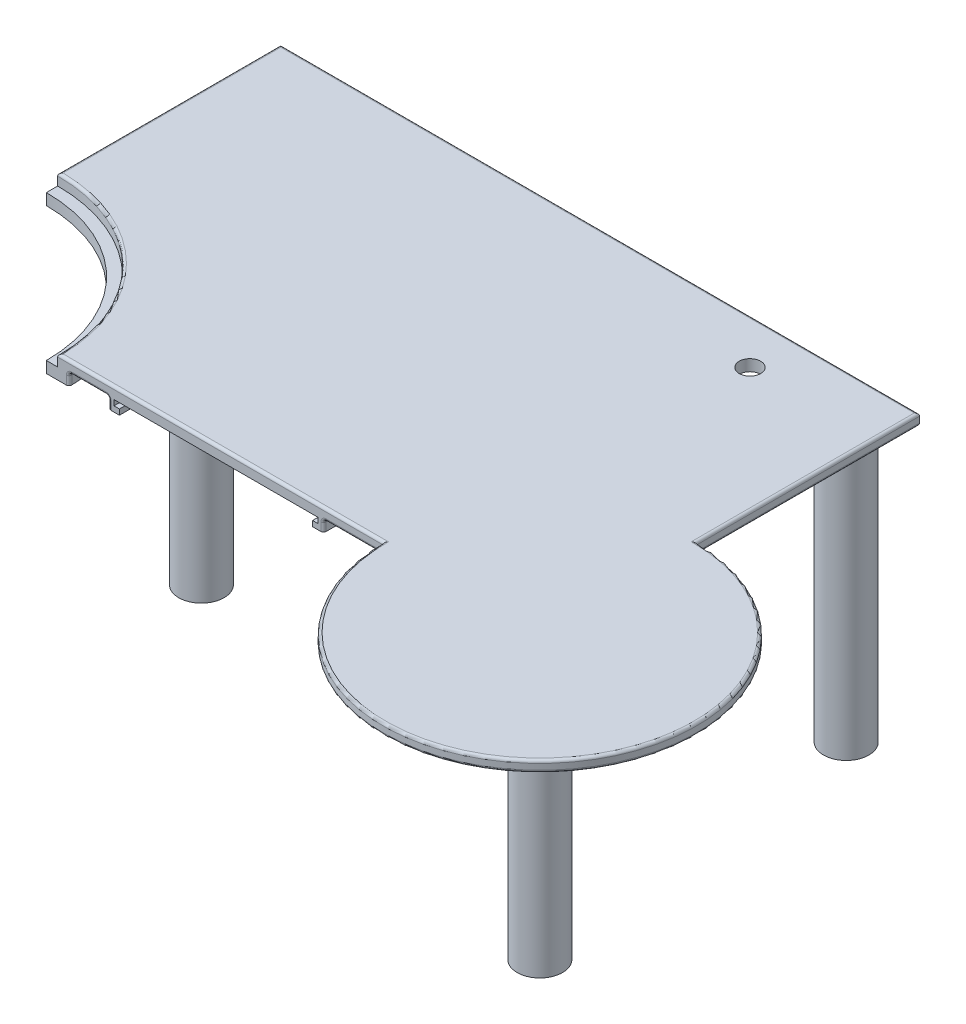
ISO-10303-21;
HEADER;
FILE_DESCRIPTION(('STEP AP214'),'2;1');
FILE_NAME('part.step','',(''),(''),'','','');
FILE_SCHEMA(('AUTOMOTIVE_DESIGN { 1 0 10303 214 1 1 1 1 }'));
ENDSEC;
DATA;
#1=APPLICATION_CONTEXT('core data for automotive mechanical design processes');
#2=APPLICATION_PROTOCOL_DEFINITION('international standard','automotive_design',2000,#1);
#3=PRODUCT_CONTEXT('',#1,'mechanical');
#4=PRODUCT('Part','Part','',(#3));
#5=PRODUCT_RELATED_PRODUCT_CATEGORY('part','',(#4));
#6=PRODUCT_DEFINITION_FORMATION('','',#4);
#7=PRODUCT_DEFINITION_CONTEXT('part definition',#1,'design');
#8=PRODUCT_DEFINITION('design','',#6,#7);
#9=PRODUCT_DEFINITION_SHAPE('','',#8);
#10=(LENGTH_UNIT() NAMED_UNIT(*) SI_UNIT(.MILLI.,.METRE.));
#11=(NAMED_UNIT(*) PLANE_ANGLE_UNIT() SI_UNIT($,.RADIAN.));
#12=(NAMED_UNIT(*) SI_UNIT($,.STERADIAN.) SOLID_ANGLE_UNIT());
#13=UNCERTAINTY_MEASURE_WITH_UNIT(LENGTH_MEASURE(1.E-05),#10,'distance_accuracy_value','');
#14=(GEOMETRIC_REPRESENTATION_CONTEXT(3) GLOBAL_UNCERTAINTY_ASSIGNED_CONTEXT((#13)) GLOBAL_UNIT_ASSIGNED_CONTEXT((#10,
#11,#12)) REPRESENTATION_CONTEXT('',''));
#15=CARTESIAN_POINT('',(0.,0.,0.));
#16=DIRECTION('',(0.,0.,1.));
#17=DIRECTION('',(1.,0.,0.));
#18=AXIS2_PLACEMENT_3D('',#15,#16,#17);
#19=CARTESIAN_POINT('',(-144.930696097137,0.,-36.0951755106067));
#20=DIRECTION('',(0.,1.,0.));
#21=DIRECTION('',(0.,0.,1.));
#22=AXIS2_PLACEMENT_3D('',#19,#20,#21);
#23=PLANE('',#22);
#24=CARTESIAN_POINT('',(14.0040027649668,0.,-73.6697580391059));
#25=DIRECTION('',(0.,1.,0.));
#26=DIRECTION('',(0.,0.,1.));
#27=AXIS2_PLACEMENT_3D('',#24,#25,#26);
#28=CIRCLE('',#27,2.00310711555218);
#29=CARTESIAN_POINT('',(14.0040027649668,0.,-71.6666509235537));
#30=VERTEX_POINT('',#29);
#31=EDGE_CURVE('E564',#30,#30,#28,.T.);
#32=ORIENTED_EDGE('',*,*,#31,.T.);
#33=EDGE_LOOP('',(#32));
#34=FACE_BOUND('',#33,.T.);
#35=CARTESIAN_POINT('',(-54.9864439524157,0.,-40.2342572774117));
#36=DIRECTION('',(0.,1.,0.));
#37=DIRECTION('',(0.,0.,1.));
#38=AXIS2_PLACEMENT_3D('',#35,#36,#37);
#39=CIRCLE('',#38,4.73964);
#40=CARTESIAN_POINT('',(-54.9864439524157,0.,-35.4946172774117));
#41=VERTEX_POINT('',#40);
#42=EDGE_CURVE('E782',#41,#41,#39,.T.);
#43=ORIENTED_EDGE('',*,*,#42,.T.);
#44=EDGE_LOOP('',(#43));
#45=FACE_BOUND('',#44,.T.);
#46=CARTESIAN_POINT('',(30.6551934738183,0.,-74.9887766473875));
#47=DIRECTION('',(0.,1.,0.));
#48=DIRECTION('',(0.,0.,1.));
#49=AXIS2_PLACEMENT_3D('',#46,#47,#48);
#50=CIRCLE('',#49,4.73964);
#51=CARTESIAN_POINT('',(30.6551934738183,0.,-70.2491366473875));
#52=VERTEX_POINT('',#51);
#53=EDGE_CURVE('E779',#52,#52,#50,.T.);
#54=ORIENTED_EDGE('',*,*,#53,.T.);
#55=EDGE_LOOP('',(#54));
#56=FACE_BOUND('',#55,.T.);
#57=DIRECTION('',(1.,0.,0.));
#58=VECTOR('',#57,1.);
#59=CARTESIAN_POINT('',(-144.930696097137,0.,-11.7186791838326));
#60=LINE('',#59,#58);
#61=CARTESIAN_POINT('',(8.4648699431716,0.,-11.7186791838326));
#62=VERTEX_POINT('',#61);
#63=CARTESIAN_POINT('',(-2.66701466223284,0.,-11.7186791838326));
#64=VERTEX_POINT('',#63);
#65=EDGE_CURVE('E774',#62,#64,#60,.F.);
#66=ORIENTED_EDGE('',*,*,#65,.T.);
#67=DIRECTION('',(0.,0.,1.));
#68=VECTOR('',#67,1.);
#69=CARTESIAN_POINT('',(-2.66701466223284,0.,-37.8028537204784));
#70=LINE('',#69,#68);
#71=CARTESIAN_POINT('',(-2.66701466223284,0.,-38.3108537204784));
#72=VERTEX_POINT('',#71);
#73=EDGE_CURVE('E776',#64,#72,#70,.F.);
#74=ORIENTED_EDGE('',*,*,#73,.T.);
#75=DIRECTION('',(-1.,0.,0.));
#76=VECTOR('',#75,1.);
#77=CARTESIAN_POINT('',(-144.930696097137,0.,-38.3108537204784));
#78=LINE('',#77,#76);
#79=CARTESIAN_POINT('',(-43.8150146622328,0.,-38.3108537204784));
#80=VERTEX_POINT('',#79);
#81=EDGE_CURVE('E763',#72,#80,#78,.T.);
#82=ORIENTED_EDGE('',*,*,#81,.T.);
#83=DIRECTION('',(0.,0.,1.));
#84=VECTOR('',#83,1.);
#85=CARTESIAN_POINT('',(-43.8150146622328,0.,-36.0951755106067));
#86=LINE('',#85,#84);
#87=CARTESIAN_POINT('',(-43.8150146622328,0.,-11.7186791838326));
#88=VERTEX_POINT('',#87);
#89=EDGE_CURVE('E750',#80,#88,#86,.T.);
#90=ORIENTED_EDGE('',*,*,#89,.T.);
#91=DIRECTION('',(1.,0.,0.));
#92=VECTOR('',#91,1.);
#93=CARTESIAN_POINT('',(-144.930696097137,0.,-11.7186791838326));
#94=LINE('',#93,#92);
#95=CARTESIAN_POINT('',(-50.1874883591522,0.,-11.7186791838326));
#96=VERTEX_POINT('',#95);
#97=EDGE_CURVE('E756',#88,#96,#94,.F.);
#98=ORIENTED_EDGE('',*,*,#97,.T.);
#99=CARTESIAN_POINT('',(-82.0789282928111,0.,-11.2106791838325));
#100=DIRECTION('',(0.,1.,0.));
#101=DIRECTION('',(0.,0.,1.));
#102=AXIS2_PLACEMENT_3D('',#99,#100,#101);
#103=CIRCLE('',#102,31.8954856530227);
#104=CARTESIAN_POINT('',(-81.570928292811,0.,-43.1021191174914));
#105=VERTEX_POINT('',#104);
#106=EDGE_CURVE('E760',#96,#105,#103,.T.);
#107=ORIENTED_EDGE('',*,*,#106,.T.);
#108=DIRECTION('',(0.,0.,1.));
#109=VECTOR('',#108,1.);
#110=CARTESIAN_POINT('',(-81.570928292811,0.,-36.0951755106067));
#111=LINE('',#110,#109);
#112=CARTESIAN_POINT('',(-81.570928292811,0.,-81.62516985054));
#113=VERTEX_POINT('',#112);
#114=EDGE_CURVE('E724',#105,#113,#111,.F.);
#115=ORIENTED_EDGE('',*,*,#114,.T.);
#116=DIRECTION('',(1.,0.,0.));
#117=VECTOR('',#116,1.);
#118=CARTESIAN_POINT('',(37.2240493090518,0.,-81.62516985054));
#119=LINE('',#118,#117);
#120=CARTESIAN_POINT('',(36.7160493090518,0.,-81.62516985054));
#121=VERTEX_POINT('',#120);
#122=EDGE_CURVE('E768',#113,#121,#119,.T.);
#123=ORIENTED_EDGE('',*,*,#122,.T.);
#124=DIRECTION('',(0.,0.,1.));
#125=VECTOR('',#124,1.);
#126=CARTESIAN_POINT('',(36.7160493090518,0.,-40.4823448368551));
#127=LINE('',#126,#125);
#128=CARTESIAN_POINT('',(36.7160493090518,0.,-39.9698585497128));
#129=VERTEX_POINT('',#128);
#130=EDGE_CURVE('E770',#121,#129,#127,.T.);
#131=ORIENTED_EDGE('',*,*,#130,.T.);
#132=CARTESIAN_POINT('',(37.2240493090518,0.,-11.2106791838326));
#133=DIRECTION('',(0.,1.,0.));
#134=DIRECTION('',(0.,0.,1.));
#135=AXIS2_PLACEMENT_3D('',#132,#133,#134);
#136=CIRCLE('',#135,28.7636656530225);
#137=EDGE_CURVE('E772',#129,#62,#136,.F.);
#138=ORIENTED_EDGE('',*,*,#137,.T.);
#139=EDGE_LOOP('',(#66,#74,#82,#90,#98,#107,#115,#123,#131,#138));
#140=FACE_BOUND('',#139,.T.);
#141=CARTESIAN_POINT('',(37.2240493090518,0.,-11.2106791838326));
#142=DIRECTION('',(0.,1.,0.));
#143=DIRECTION('',(0.,0.,1.));
#144=AXIS2_PLACEMENT_3D('',#141,#142,#143);
#145=CIRCLE('',#144,4.73964);
#146=CARTESIAN_POINT('',(37.2240493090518,0.,-6.47103918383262));
#147=VERTEX_POINT('',#146);
#148=EDGE_CURVE('E834',#147,#147,#145,.T.);
#149=ORIENTED_EDGE('',*,*,#148,.T.);
#150=EDGE_LOOP('',(#149));
#151=FACE_BOUND('',#150,.T.);
#152=CARTESIAN_POINT('',(-75.752052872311,0.,-75.6927829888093));
#153=DIRECTION('',(0.,1.,0.));
#154=DIRECTION('',(0.,0.,1.));
#155=AXIS2_PLACEMENT_3D('',#152,#153,#154);
#156=CIRCLE('',#155,4.73964);
#157=CARTESIAN_POINT('',(-75.752052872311,0.,-70.9531429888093));
#158=VERTEX_POINT('',#157);
#159=EDGE_CURVE('E895',#158,#158,#156,.T.);
#160=ORIENTED_EDGE('',*,*,#159,.T.);
#161=EDGE_LOOP('',(#160));
#162=FACE_BOUND('',#161,.T.);
#163=ADVANCED_FACE('F36',(#34,#45,#56,#140,#151,#162),#23,.F.);
#164=CARTESIAN_POINT('',(-24.0328522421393,-2.03200000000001,-36.6106791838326));
#165=DIRECTION('',(0.,-1.,0.));
#166=DIRECTION('',(1.,0.,0.));
#167=AXIS2_PLACEMENT_3D('',#164,#165,#166);
#168=PLANE('',#167);
#169=DIRECTION('',(0.,0.,1.));
#170=VECTOR('',#169,1.);
#171=CARTESIAN_POINT('',(-3.17501466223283,-2.03200000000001,-36.6106791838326));
#172=LINE('',#171,#170);
#173=CARTESIAN_POINT('',(-3.17501466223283,-2.03200000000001,-37.8028537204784));
#174=VERTEX_POINT('',#173);
#175=CARTESIAN_POINT('',(-3.17501466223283,-2.03200000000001,-11.7186791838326));
#176=VERTEX_POINT('',#175);
#177=EDGE_CURVE('E336',#174,#176,#172,.T.);
#178=ORIENTED_EDGE('',*,*,#177,.T.);
#179=CARTESIAN_POINT('',(-3.68301466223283,-2.032,-11.7186791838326));
#180=DIRECTION('',(0.,-1.,0.));
#181=DIRECTION('',(1.,0.,0.));
#182=AXIS2_PLACEMENT_3D('',#179,#180,#181);
#183=CIRCLE('',#182,0.508);
#184=CARTESIAN_POINT('',(-3.68301466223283,-2.03200000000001,-11.2106791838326));
#185=VERTEX_POINT('',#184);
#186=EDGE_CURVE('E430',#176,#185,#183,.T.);
#187=ORIENTED_EDGE('',*,*,#186,.T.);
#188=DIRECTION('',(-1.,0.,0.));
#189=VECTOR('',#188,1.);
#190=CARTESIAN_POINT('',(-24.0328522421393,-2.03200000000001,-11.2106791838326));
#191=LINE('',#190,#189);
#192=CARTESIAN_POINT('',(-5.20701466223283,-2.03200000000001,-11.2106791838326));
#193=VERTEX_POINT('',#192);
#194=EDGE_CURVE('E317',#185,#193,#191,.T.);
#195=ORIENTED_EDGE('',*,*,#194,.T.);
#196=DIRECTION('',(0.,0.,1.));
#197=VECTOR('',#196,1.);
#198=CARTESIAN_POINT('',(-5.20701466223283,-2.03200000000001,-36.6106791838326));
#199=LINE('',#198,#197);
#200=CARTESIAN_POINT('',(-5.20701466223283,-2.03200000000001,-36.6106791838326));
#201=VERTEX_POINT('',#200);
#202=EDGE_CURVE('E312',#201,#193,#199,.T.);
#203=ORIENTED_EDGE('',*,*,#202,.F.);
#204=DIRECTION('',(-1.,0.,0.));
#205=VECTOR('',#204,1.);
#206=CARTESIAN_POINT('',(-0.81910631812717,-2.03200000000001,-36.6106791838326));
#207=LINE('',#206,#205);
#208=CARTESIAN_POINT('',(-11.7459923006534,-2.03200000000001,-36.6106791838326));
#209=VERTEX_POINT('',#208);
#210=EDGE_CURVE('E304',#201,#209,#207,.T.);
#211=ORIENTED_EDGE('',*,*,#210,.T.);
#212=DIRECTION('',(0.,0.,1.));
#213=VECTOR('',#212,1.);
#214=CARTESIAN_POINT('',(-11.7459923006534,-2.032,-76.2346791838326));
#215=LINE('',#214,#213);
#216=CARTESIAN_POINT('',(-11.7459923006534,-2.03200000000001,-37.8028537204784));
#217=VERTEX_POINT('',#216);
#218=EDGE_CURVE('E285',#217,#209,#215,.T.);
#219=ORIENTED_EDGE('',*,*,#218,.F.);
#220=DIRECTION('',(-1.,0.,0.));
#221=VECTOR('',#220,1.);
#222=CARTESIAN_POINT('',(-0.81910631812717,-2.03200000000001,-37.8028537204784));
#223=LINE('',#222,#221);
#224=EDGE_CURVE('E319',#174,#217,#223,.T.);
#225=ORIENTED_EDGE('',*,*,#224,.F.);
#226=EDGE_LOOP('',(#178,#187,#195,#203,#211,#219,#225));
#227=FACE_BOUND('',#226,.T.);
#228=ADVANCED_FACE('F310',(#227),#168,.T.);
#229=DIRECTION('',(0.,0.,1.));
#230=VECTOR('',#229,1.);
#231=CARTESIAN_POINT('',(-42.2910146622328,0.,-36.6106791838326));
#232=LINE('',#231,#230);
#233=CARTESIAN_POINT('',(-42.2910146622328,0.,-36.6106791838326));
#234=VERTEX_POINT('',#233);
#235=CARTESIAN_POINT('',(-42.2910146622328,0.,-11.2106791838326));
#236=VERTEX_POINT('',#235);
#237=EDGE_CURVE('E373',#234,#236,#232,.T.);
#238=ORIENTED_EDGE('',*,*,#237,.F.);
#239=DIRECTION('',(-1.,0.,0.));
#240=VECTOR('',#239,1.);
#241=CARTESIAN_POINT('',(-0.81910631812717,0.,-36.6106791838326));
#242=LINE('',#241,#240);
#243=CARTESIAN_POINT('',(-4.19101466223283,0.,-36.6106791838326));
#244=VERTEX_POINT('',#243);
#245=EDGE_CURVE('E324',#244,#234,#242,.T.);
#246=ORIENTED_EDGE('',*,*,#245,.F.);
#247=DIRECTION('',(0.,0.,1.));
#248=VECTOR('',#247,1.);
#249=CARTESIAN_POINT('',(-4.19101466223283,0.,-36.6106791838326));
#250=LINE('',#249,#248);
#251=CARTESIAN_POINT('',(-4.19101466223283,0.,-11.2106791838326));
#252=VERTEX_POINT('',#251);
#253=EDGE_CURVE('E352',#244,#252,#250,.T.);
#254=ORIENTED_EDGE('',*,*,#253,.T.);
#255=DIRECTION('',(1.,0.,0.));
#256=VECTOR('',#255,1.);
#257=CARTESIAN_POINT('',(-144.930696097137,0.,-11.2106791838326));
#258=LINE('',#257,#256);
#259=EDGE_CURVE('E418',#236,#252,#258,.T.);
#260=ORIENTED_EDGE('',*,*,#259,.F.);
#261=EDGE_LOOP('',(#238,#246,#254,#260));
#262=FACE_BOUND('',#261,.T.);
#263=ADVANCED_FACE('F596',(#262),#23,.F.);
#264=CARTESIAN_POINT('',(-82.078928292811,2.11582,-11.2106791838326));
#265=DIRECTION('',(0.,-1.,0.));
#266=DIRECTION('',(0.,0.,-1.));
#267=AXIS2_PLACEMENT_3D('',#264,#265,#266);
#268=CYLINDRICAL_SURFACE('',#267,29.2716656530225);
#269=DIRECTION('',(0.,-1.,0.));
#270=VECTOR('',#269,1.);
#271=CARTESIAN_POINT('',(-52.8072626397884,2.11582,-11.2106791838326));
#272=LINE('',#271,#270);
#273=CARTESIAN_POINT('',(-52.8072626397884,1.60782,-11.2106791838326));
#274=VERTEX_POINT('',#273);
#275=CARTESIAN_POINT('',(-52.8072626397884,0.,-11.2106791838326));
#276=VERTEX_POINT('',#275);
#277=EDGE_CURVE('E426',#274,#276,#272,.T.);
#278=ORIENTED_EDGE('',*,*,#277,.F.);
#279=CARTESIAN_POINT('',(-82.078928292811,1.60782,-11.2106791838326));
#280=DIRECTION('',(0.,1.,0.));
#281=DIRECTION('',(0.,0.,1.));
#282=AXIS2_PLACEMENT_3D('',#279,#280,#281);
#283=CIRCLE('',#282,29.2716656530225);
#284=CARTESIAN_POINT('',(-82.078928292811,1.60782,-40.4823448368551));
#285=VERTEX_POINT('',#284);
#286=EDGE_CURVE('E11',#274,#285,#283,.T.);
#287=ORIENTED_EDGE('',*,*,#286,.T.);
#288=DIRECTION('',(0.,-1.,0.));
#289=VECTOR('',#288,1.);
#290=CARTESIAN_POINT('',(-82.078928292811,2.11582,-40.4823448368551));
#291=LINE('',#290,#289);
#292=CARTESIAN_POINT('',(-82.078928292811,0.,-40.4823448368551));
#293=VERTEX_POINT('',#292);
#294=EDGE_CURVE('E623',#285,#293,#291,.T.);
#295=ORIENTED_EDGE('',*,*,#294,.T.);
#296=CARTESIAN_POINT('',(-82.078928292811,0.,-11.2106791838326));
#297=DIRECTION('',(0.,1.,0.));
#298=DIRECTION('',(0.,0.,1.));
#299=AXIS2_PLACEMENT_3D('',#296,#297,#298);
#300=CIRCLE('',#299,29.2716656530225);
#301=EDGE_CURVE('E414',#276,#293,#300,.T.);
#302=ORIENTED_EDGE('',*,*,#301,.F.);
#303=EDGE_LOOP('',(#278,#287,#295,#302));
#304=FACE_BOUND('',#303,.T.);
#305=ADVANCED_FACE('F460',(#304),#268,.F.);
#306=CARTESIAN_POINT('',(-144.930696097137,2.11582,-11.2106791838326));
#307=DIRECTION('',(0.,0.,-1.));
#308=DIRECTION('',(-1.,0.,0.));
#309=AXIS2_PLACEMENT_3D('',#306,#307,#308);
#310=PLANE('',#309);
#311=ORIENTED_EDGE('',*,*,#194,.F.);
#312=DIRECTION('',(0.,-1.,0.));
#313=VECTOR('',#312,1.);
#314=CARTESIAN_POINT('',(-3.68301466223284,2.11582000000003,-11.2106791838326));
#315=LINE('',#314,#313);
#316=CARTESIAN_POINT('',(-3.68301466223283,-0.508000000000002,-11.2106791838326));
#317=VERTEX_POINT('',#316);
#318=EDGE_CURVE('E854',#185,#317,#315,.F.);
#319=ORIENTED_EDGE('',*,*,#318,.T.);
#320=CARTESIAN_POINT('',(-2.66701466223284,-0.508000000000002,-11.2106791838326));
#321=DIRECTION('',(0.,0.,-1.));
#322=DIRECTION('',(-1.,0.,0.));
#323=AXIS2_PLACEMENT_3D('',#320,#321,#322);
#324=CIRCLE('',#323,1.016);
#325=CARTESIAN_POINT('',(-2.66701466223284,0.508,-11.2106791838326));
#326=VERTEX_POINT('',#325);
#327=EDGE_CURVE('E843',#326,#317,#324,.F.);
#328=ORIENTED_EDGE('',*,*,#327,.F.);
#329=DIRECTION('',(1.,0.,0.));
#330=VECTOR('',#329,1.);
#331=CARTESIAN_POINT('',(-144.930696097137,0.508,-11.2106791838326));
#332=LINE('',#331,#330);
#333=CARTESIAN_POINT('',(7.95238365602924,0.508,-11.2106791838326));
#334=VERTEX_POINT('',#333);
#335=EDGE_CURVE('E840',#326,#334,#332,.T.);
#336=ORIENTED_EDGE('',*,*,#335,.T.);
#337=DIRECTION('',(0.,-1.,0.));
#338=VECTOR('',#337,1.);
#339=CARTESIAN_POINT('',(7.95238365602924,2.11582,-11.2106791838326));
#340=LINE('',#339,#338);
#341=CARTESIAN_POINT('',(7.95238365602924,1.60782,-11.2106791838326));
#342=VERTEX_POINT('',#341);
#343=EDGE_CURVE('E429',#342,#334,#340,.T.);
#344=ORIENTED_EDGE('',*,*,#343,.F.);
#345=DIRECTION('',(1.,0.,0.));
#346=VECTOR('',#345,1.);
#347=CARTESIAN_POINT('',(-52.8072626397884,1.60782,-11.2106791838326));
#348=LINE('',#347,#346);
#349=EDGE_CURVE('E432',#342,#274,#348,.F.);
#350=ORIENTED_EDGE('',*,*,#349,.T.);
#351=ORIENTED_EDGE('',*,*,#277,.T.);
#352=DIRECTION('',(-1.,0.,0.));
#353=VECTOR('',#352,1.);
#354=CARTESIAN_POINT('',(-52.8072626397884,0.,-11.2106791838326));
#355=LINE('',#354,#353);
#356=CARTESIAN_POINT('',(-54.9230826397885,0.,-11.2106791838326));
#357=VERTEX_POINT('',#356);
#358=EDGE_CURVE('E376',#276,#357,#355,.T.);
#359=ORIENTED_EDGE('',*,*,#358,.T.);
#360=DIRECTION('',(0.,1.,0.));
#361=VECTOR('',#360,1.);
#362=CARTESIAN_POINT('',(-54.9230826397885,-2.11582,-11.2106791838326));
#363=LINE('',#362,#361);
#364=CARTESIAN_POINT('',(-54.9230826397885,-2.11582,-11.2106791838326));
#365=VERTEX_POINT('',#364);
#366=EDGE_CURVE('E419',#365,#357,#363,.T.);
#367=ORIENTED_EDGE('',*,*,#366,.F.);
#368=DIRECTION('',(-1.,0.,0.));
#369=VECTOR('',#368,1.);
#370=CARTESIAN_POINT('',(-52.8072626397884,-2.11582,-11.2106791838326));
#371=LINE('',#370,#369);
#372=CARTESIAN_POINT('',(-51.2036214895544,-2.11582,-11.2106791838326));
#373=VERTEX_POINT('',#372);
#374=EDGE_CURVE('E395',#373,#365,#371,.T.);
#375=ORIENTED_EDGE('',*,*,#374,.F.);
#376=DIRECTION('',(0.,1.,0.));
#377=VECTOR('',#376,1.);
#378=CARTESIAN_POINT('',(-51.2036214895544,2.11582,-11.2106791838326));
#379=LINE('',#378,#377);
#380=CARTESIAN_POINT('',(-51.2036214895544,-0.508,-11.2106791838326));
#381=VERTEX_POINT('',#380);
#382=EDGE_CURVE('E449',#373,#381,#379,.T.);
#383=ORIENTED_EDGE('',*,*,#382,.T.);
#384=CARTESIAN_POINT('',(-50.6670500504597,-0.676127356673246,-11.7265507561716));
#385=CARTESIAN_POINT('',(-50.6595061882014,-0.673481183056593,-11.2106791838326));
#386=CARTESIAN_POINT('',(-51.1463570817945,-0.844254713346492,-11.2106791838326));
#387=CARTESIAN_POINT('',(-50.676533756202,-0.649171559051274,-11.7267113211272));
#388=CARTESIAN_POINT('',(-50.6686822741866,-0.646889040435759,-11.2106791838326));
#389=CARTESIAN_POINT('',(-51.1653192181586,-0.790343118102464,-11.2106791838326));
#390=CARTESIAN_POINT('',(-50.6836947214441,-0.621408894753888,-11.726832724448));
#391=CARTESIAN_POINT('',(-50.6756050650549,-0.619551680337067,-11.2106791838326));
#392=CARTESIAN_POINT('',(-51.1796371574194,-0.734817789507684,-11.2106791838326));
#393=CARTESIAN_POINT('',(-50.6932703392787,-0.565097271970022,-11.7269951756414));
#394=CARTESIAN_POINT('',(-50.6848595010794,-0.564140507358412,-11.2106791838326));
#395=CARTESIAN_POINT('',(-51.1987830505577,-0.622194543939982,-11.2106791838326));
#396=CARTESIAN_POINT('',(-50.6956884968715,-0.536548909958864,-11.727036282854));
#397=CARTESIAN_POINT('',(-50.6871930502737,-0.536071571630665,-11.2106791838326));
#398=CARTESIAN_POINT('',(-51.2036180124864,-0.565097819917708,-11.2106791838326));
#399=CARTESIAN_POINT('',(-50.6956919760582,-0.479436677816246,-11.7270363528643));
#400=CARTESIAN_POINT('',(-50.687195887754,-0.479914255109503,-11.2106791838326));
#401=CARTESIAN_POINT('',(-51.2036249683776,-0.450873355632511,-11.2106791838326));
#402=CARTESIAN_POINT('',(-50.6932748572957,-0.450872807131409,-11.7269952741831));
#403=CARTESIAN_POINT('',(-50.684862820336,-0.45183049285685,-11.2106791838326));
#404=CARTESIAN_POINT('',(-51.1987920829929,-0.393745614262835,-11.2106791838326));
#405=CARTESIAN_POINT('',(-50.6836800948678,-0.394561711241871,-11.7268324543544));
#406=CARTESIAN_POINT('',(-50.6755919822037,-0.396418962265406,-11.2106791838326));
#407=CARTESIAN_POINT('',(-51.1796079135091,-0.281123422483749,-11.2106791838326));
#408=CARTESIAN_POINT('',(-50.6765033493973,-0.366814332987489,-11.7267107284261));
#409=CARTESIAN_POINT('',(-50.6686565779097,-0.369095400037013,-11.2106791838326));
#410=CARTESIAN_POINT('',(-51.1652584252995,-0.225628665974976,-11.2106791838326));
#411=CARTESIAN_POINT('',(-50.6575976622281,-0.312933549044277,-11.7263907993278));
#412=CARTESIAN_POINT('',(-50.6503596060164,-0.315953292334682,-11.2106791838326));
#413=CARTESIAN_POINT('',(-51.1274575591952,-0.117867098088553,-11.2106791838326));
#414=CARTESIAN_POINT('',(-50.6458713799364,-0.286799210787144,-11.7261926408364));
#415=CARTESIAN_POINT('',(-50.6390034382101,-0.290137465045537,-11.2106791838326));
#416=CARTESIAN_POINT('',(-51.1040114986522,-0.0655984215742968,-11.2106791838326));
#417=CARTESIAN_POINT('',(-50.6181807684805,-0.236833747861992,-11.7257261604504));
#418=CARTESIAN_POINT('',(-50.6121350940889,-0.240665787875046,-11.2106791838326));
#419=CARTESIAN_POINT('',(-51.0486455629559,0.034332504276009,-11.2106791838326));
#420=CARTESIAN_POINT('',(-50.602210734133,-0.213005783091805,-11.7254577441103));
#421=CARTESIAN_POINT('',(-50.5966211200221,-0.21701531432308,-11.2106791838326));
#422=CARTESIAN_POINT('',(-51.0167142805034,0.0819884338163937,-11.2106791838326));
#423=CARTESIAN_POINT('',(-50.5665049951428,-0.168384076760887,-11.7248599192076));
#424=CARTESIAN_POINT('',(-50.5618552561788,-0.172586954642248,-11.2106791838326));
#425=CARTESIAN_POINT('',(-50.945322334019,0.171231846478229,-11.2106791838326));
#426=CARTESIAN_POINT('',(-50.5467716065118,-0.147588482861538,-11.7245305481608));
#427=CARTESIAN_POINT('',(-50.542610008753,-0.151808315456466,-11.2106791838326));
#428=CARTESIAN_POINT('',(-50.9058663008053,0.212823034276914,-11.2106791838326));
#429=CARTESIAN_POINT('',(-50.5040931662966,-0.109603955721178,-11.7238213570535));
#430=CARTESIAN_POINT('',(-50.5008799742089,-0.113697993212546,-11.2106791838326));
#431=CARTESIAN_POINT('',(-50.8205325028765,0.288792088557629,-11.2106791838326));
#432=CARTESIAN_POINT('',(-50.4811481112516,-0.0924150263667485,-11.7234415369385));
#433=CARTESIAN_POINT('',(-50.4783995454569,-0.0963657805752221,-11.2106791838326));
#434=CARTESIAN_POINT('',(-50.7746547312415,0.323169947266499,-11.2106791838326));
#435=CARTESIAN_POINT('',(-50.4326781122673,-0.0621192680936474,-11.7226431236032));
#436=CARTESIAN_POINT('',(-50.430779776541,-0.0656438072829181,-11.2106791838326));
#437=CARTESIAN_POINT('',(-50.67774060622,0.383761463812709,-11.2106791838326));
#438=CARTESIAN_POINT('',(-50.4071511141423,-0.0490157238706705,-11.7222244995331));
#439=CARTESIAN_POINT('',(-50.4056421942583,-0.0522552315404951,-11.2106791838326));
#440=CARTESIAN_POINT('',(-50.6267001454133,0.409968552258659,-11.2106791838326));
#441=CARTESIAN_POINT('',(-50.3542940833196,-0.0272962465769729,-11.7213622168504));
#442=CARTESIAN_POINT('',(-50.3534427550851,-0.0298623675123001,-11.2106791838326));
#443=CARTESIAN_POINT('',(-50.5210138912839,0.453407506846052,-11.2106791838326));
#444=CARTESIAN_POINT('',(-50.3269665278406,-0.0186742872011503,-11.7209185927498));
#445=CARTESIAN_POINT('',(-50.3263865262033,-0.0208490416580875,-11.2106791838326));
#446=CARTESIAN_POINT('',(-50.4663730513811,0.470651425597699,-11.2106791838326));
#447=CARTESIAN_POINT('',(-50.2712327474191,-0.00613150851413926,-11.7200187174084));
#448=CARTESIAN_POINT('',(-50.2710486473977,-0.00746660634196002,-11.2106791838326));
#449=CARTESIAN_POINT('',(-50.3549343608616,0.495736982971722,-11.2106791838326));
#450=CARTESIAN_POINT('',(-50.2428257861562,-0.00221395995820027,-11.7195624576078));
#451=CARTESIAN_POINT('',(-50.2427678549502,-0.00309674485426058,-11.2106791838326));
#452=CARTESIAN_POINT('',(-50.2981350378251,0.5035720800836,-11.2106791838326));
#453=CARTESIAN_POINT('',(-50.1857513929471,0.000800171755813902,-11.7186507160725));
#454=CARTESIAN_POINT('',(-50.1857897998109,0.000826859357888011,-11.2106791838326));
#455=CARTESIAN_POINT('',(-50.1840153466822,0.509600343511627,-11.2106791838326));
#456=CARTESIAN_POINT('',(-50.1570839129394,-0.000104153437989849,-11.7181952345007));
#457=CARTESIAN_POINT('',(-50.1570927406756,0.000384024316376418,-11.2106791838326));
#458=CARTESIAN_POINT('',(-50.1266948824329,0.507791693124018,-11.2106791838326));
#459=CARTESIAN_POINT('',(-50.1003215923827,-0.00671624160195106,-11.717298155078));
#460=CARTESIAN_POINT('',(-50.1001225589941,-0.00535282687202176,-11.2106791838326));
#461=CARTESIAN_POINT('',(-50.0131987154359,0.4945675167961,-11.2106791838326));
#462=CARTESIAN_POINT('',(-50.0722265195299,-0.0124220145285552,-11.7168565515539));
#463=CARTESIAN_POINT('',(-50.0718481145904,-0.0106406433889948,-11.2106791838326));
#464=CARTESIAN_POINT('',(-49.9570225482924,0.483155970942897,-11.2106791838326));
#465=CARTESIAN_POINT('',(-50.0173652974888,-0.0284509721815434,-11.7159984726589));
#466=CARTESIAN_POINT('',(-50.0165082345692,-0.0259228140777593,-11.2106791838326));
#467=CARTESIAN_POINT('',(-49.8473271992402,0.451098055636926,-11.2106791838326));
#468=CARTESIAN_POINT('',(-49.990600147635,-0.0387775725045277,-11.715582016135));
#469=CARTESIAN_POINT('',(-49.9894412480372,-0.0359170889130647,-11.2106791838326));
#470=CARTESIAN_POINT('',(-49.7938100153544,0.430444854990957,-11.2106791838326));
#471=CARTESIAN_POINT('',(-49.9649058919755,-0.0513184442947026,-11.7151841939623));
#472=CARTESIAN_POINT('',(-49.9633857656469,-0.0481979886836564,-11.2106791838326));
#473=CARTESIAN_POINT('',(-49.7424340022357,0.405363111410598,-11.2106791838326));
#474=(BOUNDED_SURFACE() B_SPLINE_SURFACE(3,2,((#384,#385,#386),(#387,#388,#389),(#390,#391,
#392),(#393,#394,#395),(#396,#397,#398),(#399,#400,#401),(#402,#403,#404),(#405,#406,#407),
(#408,#409,#410),(#411,#412,#413),(#414,#415,#416),(#417,#418,#419),(#420,#421,#422),(#423,#424,
#425),(#426,#427,#428),(#429,#430,#431),(#432,#433,#434),(#435,#436,#437),(#438,#439,#440),
(#441,#442,#443),(#444,#445,#446),(#447,#448,#449),(#450,#451,#452),(#453,#454,#455),(#456,#457,
#458),(#459,#460,#461),(#462,#463,#464),(#465,#466,#467),(#468,#469,#470),(#471,#472,#473)),
.UNSPECIFIED.,.F.,.F.,.F.) B_SPLINE_SURFACE_WITH_KNOTS((4,2,2,2,2,2,2,2,2,2,2,2,2,2,4),(3,3),
(0.,0.171219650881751,0.342312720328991,0.513492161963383,0.6846393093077,0.855686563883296,
1.02696494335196,1.19813825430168,1.36931174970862,1.54062251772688,1.71170232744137,
1.88290101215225,2.0541319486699,2.2252919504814,2.3965786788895),(0.,1.),
.UNSPECIFIED.) GEOMETRIC_REPRESENTATION_ITEM() RATIONAL_B_SPLINE_SURFACE(((1.,0.701607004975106,
1.),(1.,0.701494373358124,1.),(1.,0.701409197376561,1.),(1.,0.70129521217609,1.),(1.,
0.701266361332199,1.),(1.,0.701266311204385,1.),(1.,0.701295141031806,1.),(1.,0.701409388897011,
1.),(1.,0.701494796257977,1.),(1.,0.701719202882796,1.),(1.,0.701858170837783,1.),(1.,
0.702185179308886,1.),(1.,0.70237328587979,1.),(1.,0.702792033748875,1.),(1.,0.703022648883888,
1.),(1.,0.703518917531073,1.),(1.,0.703784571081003,1.),(1.,0.704342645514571,1.),(1.,
0.704635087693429,1.),(1.,0.705237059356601,1.),(1.,0.705546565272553,1.),(1.,0.7061739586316,
1.),(1.,0.706491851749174,1.),(1.,0.707126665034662,1.),(1.,0.707443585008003,1.),(1.,
0.708067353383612,1.),(1.,0.708374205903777,1.),(1.,0.708970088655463,1.),(1.,0.709259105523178,
1.),(1.,0.709535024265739,1.))) REPRESENTATION_ITEM('') SURFACE());
#475=CARTESIAN_POINT('',(-49.7424340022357,0.405363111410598,-11.2106791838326));
#476=CARTESIAN_POINT('',(-49.7938100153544,0.430444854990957,-11.2106791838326));
#477=CARTESIAN_POINT('',(-49.8473271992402,0.451098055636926,-11.2106791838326));
#478=CARTESIAN_POINT('',(-49.9570225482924,0.483155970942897,-11.2106791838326));
#479=CARTESIAN_POINT('',(-50.0131987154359,0.4945675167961,-11.2106791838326));
#480=CARTESIAN_POINT('',(-50.1266948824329,0.507791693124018,-11.2106791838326));
#481=CARTESIAN_POINT('',(-50.1840153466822,0.509600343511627,-11.2106791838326));
#482=CARTESIAN_POINT('',(-50.2981350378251,0.5035720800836,-11.2106791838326));
#483=CARTESIAN_POINT('',(-50.3549343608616,0.495736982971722,-11.2106791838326));
#484=CARTESIAN_POINT('',(-50.4663730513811,0.470651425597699,-11.2106791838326));
#485=CARTESIAN_POINT('',(-50.5210138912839,0.453407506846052,-11.2106791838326));
#486=CARTESIAN_POINT('',(-50.6267001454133,0.409968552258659,-11.2106791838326));
#487=CARTESIAN_POINT('',(-50.67774060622,0.383761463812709,-11.2106791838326));
#488=CARTESIAN_POINT('',(-50.7746547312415,0.323169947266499,-11.2106791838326));
#489=CARTESIAN_POINT('',(-50.8205325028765,0.288792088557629,-11.2106791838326));
#490=CARTESIAN_POINT('',(-50.9058663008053,0.212823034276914,-11.2106791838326));
#491=CARTESIAN_POINT('',(-50.9453223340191,0.171231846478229,-11.2106791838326));
#492=CARTESIAN_POINT('',(-51.0167142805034,0.0819884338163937,-11.2106791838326));
#493=CARTESIAN_POINT('',(-51.0486455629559,0.0343325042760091,-11.2106791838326));
#494=CARTESIAN_POINT('',(-51.1040114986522,-0.0655984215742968,-11.2106791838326));
#495=CARTESIAN_POINT('',(-51.1274575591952,-0.117867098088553,-11.2106791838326));
#496=CARTESIAN_POINT('',(-51.1652584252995,-0.225628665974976,-11.2106791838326));
#497=CARTESIAN_POINT('',(-51.1796079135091,-0.281123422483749,-11.2106791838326));
#498=CARTESIAN_POINT('',(-51.1987920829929,-0.393745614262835,-11.2106791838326));
#499=CARTESIAN_POINT('',(-51.2036249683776,-0.450873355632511,-11.2106791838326));
#500=CARTESIAN_POINT('',(-51.2036180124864,-0.565097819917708,-11.2106791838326));
#501=CARTESIAN_POINT('',(-51.1987830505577,-0.622194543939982,-11.2106791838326));
#502=CARTESIAN_POINT('',(-51.1796371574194,-0.734817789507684,-11.2106791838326));
#503=CARTESIAN_POINT('',(-51.1653192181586,-0.790343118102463,-11.2106791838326));
#504=CARTESIAN_POINT('',(-51.1463570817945,-0.844254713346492,-11.2106791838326));
#505=B_SPLINE_CURVE_WITH_KNOTS('',3,(#475,#476,#477,#478,#479,#480,#481,#482,#483,#484,#485,
#486,#487,#488,#489,#490,#491,#492,#493,#494,#495,#496,#497,#498,#499,#500,#501,#502,#503,#504),
.UNSPECIFIED.,.F.,.F.,(4,2,2,2,2,2,2,2,2,2,2,2,2,2,4),(0.,0.171286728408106,0.342446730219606,
0.513677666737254,0.684876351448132,0.855956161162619,1.02726692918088,1.19844042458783,
1.36961373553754,1.54089211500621,1.7119393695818,1.88308651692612,2.05426595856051,
2.22535902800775,2.3965786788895),.UNSPECIFIED.);
#506=CARTESIAN_POINT('',(-50.1874883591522,0.508,-11.2106791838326));
#507=VERTEX_POINT('',#506);
#508=EDGE_CURVE('E441',#507,#381,#505,.T.);
#509=ORIENTED_EDGE('',*,*,#508,.F.);
#510=DIRECTION('',(1.,0.,0.));
#511=VECTOR('',#510,1.);
#512=CARTESIAN_POINT('',(-144.930696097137,0.508,-11.2106791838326));
#513=LINE('',#512,#511);
#514=CARTESIAN_POINT('',(-43.8150146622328,0.508,-11.2106791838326));
#515=VERTEX_POINT('',#514);
#516=EDGE_CURVE('E437',#507,#515,#513,.T.);
#517=ORIENTED_EDGE('',*,*,#516,.T.);
#518=CARTESIAN_POINT('',(-43.8150146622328,-0.508,-11.2106791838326));
#519=DIRECTION('',(0.,0.,-1.));
#520=DIRECTION('',(-1.,0.,0.));
#521=AXIS2_PLACEMENT_3D('',#518,#519,#520);
#522=CIRCLE('',#521,1.016);
#523=CARTESIAN_POINT('',(-42.7990146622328,-0.508,-11.2106791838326));
#524=VERTEX_POINT('',#523);
#525=EDGE_CURVE('E434',#524,#515,#522,.F.);
#526=ORIENTED_EDGE('',*,*,#525,.F.);
#527=DIRECTION('',(0.,-1.,0.));
#528=VECTOR('',#527,1.);
#529=CARTESIAN_POINT('',(-42.7990146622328,-2.03200000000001,-11.2106791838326));
#530=LINE('',#529,#528);
#531=CARTESIAN_POINT('',(-42.7990146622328,-2.03200000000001,-11.2106791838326));
#532=VERTEX_POINT('',#531);
#533=EDGE_CURVE('E439',#524,#532,#530,.T.);
#534=ORIENTED_EDGE('',*,*,#533,.T.);
#535=DIRECTION('',(1.,0.,0.));
#536=VECTOR('',#535,1.);
#537=CARTESIAN_POINT('',(-24.0328522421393,-2.03200000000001,-11.2106791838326));
#538=LINE('',#537,#536);
#539=CARTESIAN_POINT('',(-41.2750146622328,-2.03200000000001,-11.2106791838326));
#540=VERTEX_POINT('',#539);
#541=EDGE_CURVE('E347',#532,#540,#538,.T.);
#542=ORIENTED_EDGE('',*,*,#541,.T.);
#543=DIRECTION('',(0.,-1.,0.));
#544=VECTOR('',#543,1.);
#545=CARTESIAN_POINT('',(-41.2750146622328,-49.0286854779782,-11.2106791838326));
#546=LINE('',#545,#544);
#547=CARTESIAN_POINT('',(-41.2750146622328,-1.016,-11.2106791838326));
#548=VERTEX_POINT('',#547);
#549=EDGE_CURVE('E367',#548,#540,#546,.T.);
#550=ORIENTED_EDGE('',*,*,#549,.F.);
#551=DIRECTION('',(1.,0.,0.));
#552=VECTOR('',#551,1.);
#553=CARTESIAN_POINT('',(-24.0328522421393,-1.016,-11.2106791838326));
#554=LINE('',#553,#552);
#555=CARTESIAN_POINT('',(-42.2910146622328,-1.016,-11.2106791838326));
#556=VERTEX_POINT('',#555);
#557=EDGE_CURVE('E370',#556,#548,#554,.T.);
#558=ORIENTED_EDGE('',*,*,#557,.F.);
#559=DIRECTION('',(0.,-1.,0.));
#560=VECTOR('',#559,1.);
#561=CARTESIAN_POINT('',(-42.2910146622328,-49.0286854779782,-11.2106791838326));
#562=LINE('',#561,#560);
#563=EDGE_CURVE('E359',#236,#556,#562,.T.);
#564=ORIENTED_EDGE('',*,*,#563,.F.);
#565=ORIENTED_EDGE('',*,*,#259,.T.);
#566=DIRECTION('',(0.,-1.,0.));
#567=VECTOR('',#566,1.);
#568=CARTESIAN_POINT('',(-4.19101466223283,-49.0286854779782,-11.2106791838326));
#569=LINE('',#568,#567);
#570=CARTESIAN_POINT('',(-4.19101466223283,-1.016,-11.2106791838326));
#571=VERTEX_POINT('',#570);
#572=EDGE_CURVE('E338',#252,#571,#569,.T.);
#573=ORIENTED_EDGE('',*,*,#572,.T.);
#574=DIRECTION('',(-1.,0.,0.));
#575=VECTOR('',#574,1.);
#576=CARTESIAN_POINT('',(-24.0328522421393,-1.016,-11.2106791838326));
#577=LINE('',#576,#575);
#578=CARTESIAN_POINT('',(-5.20701466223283,-1.016,-11.2106791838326));
#579=VERTEX_POINT('',#578);
#580=EDGE_CURVE('E341',#571,#579,#577,.T.);
#581=ORIENTED_EDGE('',*,*,#580,.T.);
#582=DIRECTION('',(0.,-1.,0.));
#583=VECTOR('',#582,1.);
#584=CARTESIAN_POINT('',(-5.20701466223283,-49.0286854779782,-11.2106791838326));
#585=LINE('',#584,#583);
#586=EDGE_CURVE('E331',#579,#193,#585,.T.);
#587=ORIENTED_EDGE('',*,*,#586,.T.);
#588=EDGE_LOOP('',(#311,#319,#328,#336,#344,#350,#351,#359,#367,#375,#383,#509,#517,#526,#534,
#542,#550,#558,#564,#565,#573,#581,#587));
#589=FACE_BOUND('',#588,.T.);
#590=ADVANCED_FACE('F455',(#589),#310,.F.);
#591=CARTESIAN_POINT('',(37.2240493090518,2.11582,-11.2106791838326));
#592=DIRECTION('',(0.,-1.,0.));
#593=DIRECTION('',(0.,0.,-1.));
#594=AXIS2_PLACEMENT_3D('',#591,#592,#593);
#595=CYLINDRICAL_SURFACE('',#594,29.2716656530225);
#596=ORIENTED_EDGE('',*,*,#343,.T.);
#597=CARTESIAN_POINT('',(37.2240493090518,0.508,-11.2106791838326));
#598=DIRECTION('',(0.,1.,0.));
#599=DIRECTION('',(0.,0.,1.));
#600=AXIS2_PLACEMENT_3D('',#597,#598,#599);
#601=CIRCLE('',#600,29.2716656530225);
#602=CARTESIAN_POINT('',(37.2240493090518,0.508,-40.4823448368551));
#603=VERTEX_POINT('',#602);
#604=EDGE_CURVE('E790',#334,#603,#601,.T.);
#605=ORIENTED_EDGE('',*,*,#604,.T.);
#606=DIRECTION('',(0.,-1.,0.));
#607=VECTOR('',#606,1.);
#608=CARTESIAN_POINT('',(37.2240493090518,2.11582,-40.4823448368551));
#609=LINE('',#608,#607);
#610=CARTESIAN_POINT('',(37.2240493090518,1.60782,-40.4823448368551));
#611=VERTEX_POINT('',#610);
#612=EDGE_CURVE('E1437',#611,#603,#609,.T.);
#613=ORIENTED_EDGE('',*,*,#612,.F.);
#614=CARTESIAN_POINT('',(37.2240493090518,1.60782,-11.2106791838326));
#615=DIRECTION('',(0.,1.,0.));
#616=DIRECTION('',(0.,0.,1.));
#617=AXIS2_PLACEMENT_3D('',#614,#615,#616);
#618=CIRCLE('',#617,29.2716656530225);
#619=EDGE_CURVE('E788',#611,#342,#618,.F.);
#620=ORIENTED_EDGE('',*,*,#619,.T.);
#621=EDGE_LOOP('',(#596,#605,#613,#620));
#622=FACE_BOUND('',#621,.T.);
#623=ADVANCED_FACE('F459',(#622),#595,.T.);
#624=CARTESIAN_POINT('',(37.2240493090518,2.11582,-36.0951755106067));
#625=DIRECTION('',(1.,0.,0.));
#626=DIRECTION('',(0.,0.,-1.));
#627=AXIS2_PLACEMENT_3D('',#624,#625,#626);
#628=PLANE('',#627);
#629=ORIENTED_EDGE('',*,*,#612,.T.);
#630=DIRECTION('',(0.,0.,1.));
#631=VECTOR('',#630,1.);
#632=CARTESIAN_POINT('',(37.2240493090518,0.508,-82.13316985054));
#633=LINE('',#632,#631);
#634=CARTESIAN_POINT('',(37.2240493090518,0.508,-82.13316985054));
#635=VERTEX_POINT('',#634);
#636=EDGE_CURVE('E794',#603,#635,#633,.F.);
#637=ORIENTED_EDGE('',*,*,#636,.T.);
#638=DIRECTION('',(0.,-1.,0.));
#639=VECTOR('',#638,1.);
#640=CARTESIAN_POINT('',(37.2240493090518,2.11582,-82.13316985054));
#641=LINE('',#640,#639);
#642=CARTESIAN_POINT('',(37.2240493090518,1.60782,-82.13316985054));
#643=VERTEX_POINT('',#642);
#644=EDGE_CURVE('E629',#643,#635,#641,.T.);
#645=ORIENTED_EDGE('',*,*,#644,.F.);
#646=DIRECTION('',(0.,0.,1.));
#647=VECTOR('',#646,1.);
#648=CARTESIAN_POINT('',(37.2240493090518,1.60782,-36.0951755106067));
#649=LINE('',#648,#647);
#650=EDGE_CURVE('E792',#643,#611,#649,.T.);
#651=ORIENTED_EDGE('',*,*,#650,.T.);
#652=EDGE_LOOP('',(#629,#637,#645,#651));
#653=FACE_BOUND('',#652,.T.);
#654=ADVANCED_FACE('F1104',(#653),#628,.T.);
#655=CARTESIAN_POINT('',(-144.930696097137,2.11582,-82.13316985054));
#656=DIRECTION('',(0.,0.,-1.));
#657=DIRECTION('',(-1.,0.,0.));
#658=AXIS2_PLACEMENT_3D('',#655,#656,#657);
#659=PLANE('',#658);
#660=ORIENTED_EDGE('',*,*,#644,.T.);
#661=DIRECTION('',(1.,0.,0.));
#662=VECTOR('',#661,1.);
#663=CARTESIAN_POINT('',(-82.078928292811,0.508,-82.13316985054));
#664=LINE('',#663,#662);
#665=CARTESIAN_POINT('',(-82.078928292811,0.508,-82.13316985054));
#666=VERTEX_POINT('',#665);
#667=EDGE_CURVE('E798',#635,#666,#664,.F.);
#668=ORIENTED_EDGE('',*,*,#667,.T.);
#669=DIRECTION('',(0.,-1.,0.));
#670=VECTOR('',#669,1.);
#671=CARTESIAN_POINT('',(-82.078928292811,2.11582,-82.13316985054));
#672=LINE('',#671,#670);
#673=CARTESIAN_POINT('',(-82.078928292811,1.60782,-82.13316985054));
#674=VERTEX_POINT('',#673);
#675=EDGE_CURVE('E624',#674,#666,#672,.T.);
#676=ORIENTED_EDGE('',*,*,#675,.F.);
#677=DIRECTION('',(1.,0.,0.));
#678=VECTOR('',#677,1.);
#679=CARTESIAN_POINT('',(-144.930696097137,1.60782,-82.13316985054));
#680=LINE('',#679,#678);
#681=EDGE_CURVE('E796',#674,#643,#680,.T.);
#682=ORIENTED_EDGE('',*,*,#681,.T.);
#683=EDGE_LOOP('',(#660,#668,#676,#682));
#684=FACE_BOUND('',#683,.T.);
#685=ADVANCED_FACE('F971',(#684),#659,.T.);
#686=CARTESIAN_POINT('',(-82.078928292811,2.11582,-36.0951755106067));
#687=DIRECTION('',(1.,0.,0.));
#688=DIRECTION('',(0.,0.,-1.));
#689=AXIS2_PLACEMENT_3D('',#686,#687,#688);
#690=PLANE('',#689);
#691=CARTESIAN_POINT('',(-81.5735788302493,-0.0286442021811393,-43.2703548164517));
#692=CARTESIAN_POINT('',(-82.078928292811,-0.0261561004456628,-43.2712276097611));
#693=CARTESIAN_POINT('',(-82.078928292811,0.450711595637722,-43.4385065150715));
#694=CARTESIAN_POINT('',(-81.5731583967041,-0.0191590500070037,-43.2433818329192));
#695=CARTESIAN_POINT('',(-82.078928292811,-0.0170090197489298,-43.2439614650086));
#696=CARTESIAN_POINT('',(-82.078928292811,0.469681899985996,-43.3845738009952));
#697=CARTESIAN_POINT('',(-81.5727230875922,-0.011997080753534,-43.2156013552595));
#698=CARTESIAN_POINT('',(-82.078928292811,-0.0102440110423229,-43.215962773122));
#699=CARTESIAN_POINT('',(-82.078928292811,0.484005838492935,-43.3290266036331));
#700=CARTESIAN_POINT('',(-81.5718354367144,-0.00242017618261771,-43.15925342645));
#701=CARTESIAN_POINT('',(-82.078928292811,-0.00151290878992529,-43.1593196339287));
#702=CARTESIAN_POINT('',(-82.078928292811,0.503159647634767,-43.216358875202));
#703=CARTESIAN_POINT('',(-81.5713831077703,-1.73756922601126E-06,-43.1306865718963));
#704=CARTESIAN_POINT('',(-82.078928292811,0.000452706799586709,-43.1306740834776));
#705=CARTESIAN_POINT('',(-82.078928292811,0.507996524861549,-43.1592395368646));
#706=CARTESIAN_POINT('',(-81.5704732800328,1.73832497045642E-06,-43.0735392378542));
#707=CARTESIAN_POINT('',(-82.078928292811,-0.000453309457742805,-43.0735261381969));
#708=CARTESIAN_POINT('',(-82.078928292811,0.50800347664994,-43.0449738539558));
#709=CARTESIAN_POINT('',(-81.5700157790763,-0.0024153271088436,-43.0449587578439));
#710=CARTESIAN_POINT('',(-82.078928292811,-0.00333138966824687,-43.0450236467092));
#711=CARTESIAN_POINT('',(-82.078928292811,0.503169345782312,-42.9878275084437));
#712=CARTESIAN_POINT('',(-81.5691090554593,-0.0120099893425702,-42.9886146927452));
#713=CARTESIAN_POINT('',(-82.078928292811,-0.0137988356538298,-42.9889846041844));
#714=CARTESIAN_POINT('',(-82.078928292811,0.48398002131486,-42.875168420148));
#715=CARTESIAN_POINT('',(-81.5686598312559,-0.0191866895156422,-42.9608509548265));
#716=CARTESIAN_POINT('',(-82.078928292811,-0.021391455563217,-42.9614491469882));
#717=CARTESIAN_POINT('',(-82.078928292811,0.469626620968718,-42.8196553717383));
#718=CARTESIAN_POINT('',(-81.5677831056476,-0.0380926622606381,-42.9069380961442));
#719=CARTESIAN_POINT('',(-82.078928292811,-0.0410322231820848,-42.9081181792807));
#720=CARTESIAN_POINT('',(-82.078928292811,0.431814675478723,-42.7118578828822));
#721=CARTESIAN_POINT('',(-81.5673555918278,-0.0498192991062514,-42.8807880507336));
#722=CARTESIAN_POINT('',(-82.078928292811,-0.0530812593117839,-42.8823242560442));
#723=CARTESIAN_POINT('',(-82.078928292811,0.408361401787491,-42.6595715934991));
#724=CARTESIAN_POINT('',(-81.56653447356,-0.0775114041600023,-42.8307927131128));
#725=CARTESIAN_POINT('',(-82.078928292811,-0.0812841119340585,-42.8331279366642));
#726=CARTESIAN_POINT('',(-82.078928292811,0.352977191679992,-42.559607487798));
#727=CARTESIAN_POINT('',(-81.5661409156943,-0.0934825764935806,-42.806950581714));
#728=CARTESIAN_POINT('',(-82.078928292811,-0.0974458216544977,-42.8097324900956));
#729=CARTESIAN_POINT('',(-82.078928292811,0.321034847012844,-42.5119359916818));
#730=CARTESIAN_POINT('',(-81.5654009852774,-0.129189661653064,-42.7623056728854));
#731=CARTESIAN_POINT('',(-82.078928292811,-0.133376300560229,-42.7660168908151));
#732=CARTESIAN_POINT('',(-82.078928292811,0.249620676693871,-42.4226702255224));
#733=CARTESIAN_POINT('',(-81.5650545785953,-0.148922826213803,-42.7415006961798));
#734=CARTESIAN_POINT('',(-82.078928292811,-0.153143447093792,-42.7456987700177));
#735=CARTESIAN_POINT('',(-82.078928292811,0.210154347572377,-42.3810715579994));
#736=CARTESIAN_POINT('',(-81.5644197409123,-0.191601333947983,-42.7035002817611));
#737=CARTESIAN_POINT('',(-82.078928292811,-0.195727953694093,-42.7086527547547));
#738=CARTESIAN_POINT('',(-82.078928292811,0.124797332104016,-42.3050914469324));
#739=CARTESIAN_POINT('',(-81.5641313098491,-0.214546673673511,-42.6863048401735));
#740=CARTESIAN_POINT('',(-82.078928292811,-0.218544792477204,-42.691929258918));
#741=CARTESIAN_POINT('',(-82.078928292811,0.0789066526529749,-42.2707099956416));
#742=CARTESIAN_POINT('',(-81.5636217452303,-0.263011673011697,-42.656003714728));
#743=CARTESIAN_POINT('',(-82.078928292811,-0.26660532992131,-42.6624986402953));
#744=CARTESIAN_POINT('',(-82.078928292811,-0.0180233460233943,-42.2101244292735));
#745=CARTESIAN_POINT('',(-81.5634006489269,-0.288532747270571,-42.6429002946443));
#746=CARTESIAN_POINT('',(-82.078928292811,-0.291848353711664,-42.6497977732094));
#747=CARTESIAN_POINT('',(-82.078928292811,-0.0690654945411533,-42.1839248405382));
#748=CARTESIAN_POINT('',(-81.5630335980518,-0.341377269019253,-42.6211835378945));
#749=CARTESIAN_POINT('',(-82.078928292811,-0.344022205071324,-42.6287655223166));
#750=CARTESIAN_POINT('',(-82.078928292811,-0.174754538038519,-42.1405033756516));
#751=CARTESIAN_POINT('',(-81.5628875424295,-0.368698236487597,-42.6125641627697));
#752=CARTESIAN_POINT('',(-82.078928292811,-0.370947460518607,-42.6204314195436));
#753=CARTESIAN_POINT('',(-82.078928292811,-0.229396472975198,-42.1232694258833));
#754=CARTESIAN_POINT('',(-81.5626750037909,-0.42441150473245,-42.6000308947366));
#755=CARTESIAN_POINT('',(-82.078928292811,-0.425800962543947,-42.60831637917));
#756=CARTESIAN_POINT('',(-82.078928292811,-0.340823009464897,-42.098209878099));
#757=CARTESIAN_POINT('',(-81.562608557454,-0.452804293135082,-42.5961191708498));
#758=CARTESIAN_POINT('',(-82.078928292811,-0.453725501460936,-42.6045394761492));
#759=CARTESIAN_POINT('',(-82.078928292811,-0.39760858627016,-42.0903886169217));
#760=CARTESIAN_POINT('',(-81.5625575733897,-0.509849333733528,-42.5931173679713));
#761=CARTESIAN_POINT('',(-82.078928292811,-0.509820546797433,-42.6016405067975));
#762=CARTESIAN_POINT('',(-82.078928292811,-0.511698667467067,-42.0843866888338));
#763=CARTESIAN_POINT('',(-81.5625730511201,-0.538501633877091,-42.5940281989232));
#764=CARTESIAN_POINT('',(-82.078928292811,-0.537986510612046,-42.6025197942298));
#765=CARTESIAN_POINT('',(-82.078928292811,-0.569003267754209,-42.0862078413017));
#766=CARTESIAN_POINT('',(-81.5626855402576,-0.595229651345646,-42.6006533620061));
#767=CARTESIAN_POINT('',(-82.078928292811,-0.593786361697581,-42.6089191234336));
#768=CARTESIAN_POINT('',(-82.078928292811,-0.682459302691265,-42.0994544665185));
#769=CARTESIAN_POINT('',(-81.5627825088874,-0.62330566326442,-42.6063651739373));
#770=CARTESIAN_POINT('',(-82.078928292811,-0.621416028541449,-42.6144356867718));
#771=CARTESIAN_POINT('',(-82.078928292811,-0.738611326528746,-42.1108749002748));
#772=CARTESIAN_POINT('',(-81.5630541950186,-0.678128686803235,-42.6224051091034));
#773=CARTESIAN_POINT('',(-82.078928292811,-0.675438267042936,-42.629951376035));
#774=CARTESIAN_POINT('',(-82.078928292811,-0.84825737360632,-42.1429458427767));
#775=CARTESIAN_POINT('',(-81.5632289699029,-0.70487470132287,-42.6327366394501));
#776=CARTESIAN_POINT('',(-82.078928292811,-0.701826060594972,-42.6399513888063));
#777=CARTESIAN_POINT('',(-82.078928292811,-0.901749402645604,-42.1636031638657));
#778=CARTESIAN_POINT('',(-81.5634407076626,-0.730550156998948,-42.6452816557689));
#779=CARTESIAN_POINT('',(-82.078928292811,-0.727220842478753,-42.6521122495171));
#780=CARTESIAN_POINT('',(-82.078928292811,-0.953100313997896,-42.1886862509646));
#781=(BOUNDED_SURFACE() B_SPLINE_SURFACE(3,2,((#691,#692,#693),(#694,#695,#696),(#697,#698,
#699),(#700,#701,#702),(#703,#704,#705),(#706,#707,#708),(#709,#710,#711),(#712,#713,#714),
(#715,#716,#717),(#718,#719,#720),(#721,#722,#723),(#724,#725,#726),(#727,#728,#729),(#730,#731,
#732),(#733,#734,#735),(#736,#737,#738),(#739,#740,#741),(#742,#743,#744),(#745,#746,#747),
(#748,#749,#750),(#751,#752,#753),(#754,#755,#756),(#757,#758,#759),(#760,#761,#762),(#763,#764,
#765),(#766,#767,#768),(#769,#770,#771),(#772,#773,#774),(#775,#776,#777),(#778,#779,#780)),
.UNSPECIFIED.,.F.,.F.,.F.) B_SPLINE_SURFACE_WITH_KNOTS((4,2,2,2,2,2,2,2,2,2,2,2,2,2,4),(3,3),
(0.,0.171287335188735,0.342448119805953,0.513683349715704,0.684886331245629,0.855990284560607,
1.02732535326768,1.19853573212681,1.36974592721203,1.54105067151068,1.71212412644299,
1.88327637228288,2.05446091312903,2.22555564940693,2.39677677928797),(0.,1.),
.UNSPECIFIED.) GEOMETRIC_REPRESENTATION_ITEM() RATIONAL_B_SPLINE_SURFACE(((1.,0.708949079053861,
1.),(1.,0.708657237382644,1.),(1.,0.708354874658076,1.),(1.,0.707737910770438,1.),(1.,
0.707423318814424,1.),(1.,0.706790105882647,1.),(1.,0.706471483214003,1.),(1.,0.705839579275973,
1.),(1.,0.705526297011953,1.),(1.,0.704914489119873,1.),(1.,0.70461595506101,1.),(1.,
0.704042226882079,1.),(1.,0.703767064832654,1.),(1.,0.703249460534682,1.),(1.,0.703006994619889,
1.),(1.,0.702562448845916,1.),(1.,0.702360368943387,1.),(1.,0.702003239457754,1.),(1.,
0.701848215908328,1.),(1.,0.701590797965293,1.),(1.,0.701488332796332,1.),(1.,0.701339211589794,
1.),(1.,0.701292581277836,1.),(1.,0.701256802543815,1.),(1.,0.701267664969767,1.),(1.,
0.701346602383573,1.),(1.,0.701414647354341,1.),(1.,0.701605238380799,1.),(1.,0.701727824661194,
1.),(1.,0.701876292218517,1.))) REPRESENTATION_ITEM('') SURFACE());
#782=CARTESIAN_POINT('',(-82.078928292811,-0.953100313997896,-42.1886862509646));
#783=CARTESIAN_POINT('',(-82.078928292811,-0.901749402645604,-42.1636031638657));
#784=CARTESIAN_POINT('',(-82.078928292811,-0.84825737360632,-42.1429458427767));
#785=CARTESIAN_POINT('',(-82.078928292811,-0.738611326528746,-42.1108749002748));
#786=CARTESIAN_POINT('',(-82.078928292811,-0.682459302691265,-42.0994544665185));
#787=CARTESIAN_POINT('',(-82.078928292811,-0.569003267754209,-42.0862078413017));
#788=CARTESIAN_POINT('',(-82.078928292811,-0.511698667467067,-42.0843866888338));
#789=CARTESIAN_POINT('',(-82.078928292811,-0.39760858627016,-42.0903886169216));
#790=CARTESIAN_POINT('',(-82.078928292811,-0.340823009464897,-42.098209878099));
#791=CARTESIAN_POINT('',(-82.078928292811,-0.229396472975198,-42.1232694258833));
#792=CARTESIAN_POINT('',(-82.078928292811,-0.174754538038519,-42.1405033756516));
#793=CARTESIAN_POINT('',(-82.078928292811,-0.0690654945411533,-42.1839248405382));
#794=CARTESIAN_POINT('',(-82.078928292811,-0.0180233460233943,-42.2101244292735));
#795=CARTESIAN_POINT('',(-82.078928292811,0.0789066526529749,-42.2707099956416));
#796=CARTESIAN_POINT('',(-82.078928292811,0.124797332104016,-42.3050914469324));
#797=CARTESIAN_POINT('',(-82.078928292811,0.210154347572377,-42.3810715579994));
#798=CARTESIAN_POINT('',(-82.078928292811,0.249620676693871,-42.4226702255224));
#799=CARTESIAN_POINT('',(-82.078928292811,0.321034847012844,-42.5119359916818));
#800=CARTESIAN_POINT('',(-82.078928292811,0.352977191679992,-42.559607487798));
#801=CARTESIAN_POINT('',(-82.078928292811,0.408361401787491,-42.6595715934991));
#802=CARTESIAN_POINT('',(-82.078928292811,0.431814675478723,-42.7118578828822));
#803=CARTESIAN_POINT('',(-82.078928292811,0.469626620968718,-42.8196553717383));
#804=CARTESIAN_POINT('',(-82.078928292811,0.48398002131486,-42.875168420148));
#805=CARTESIAN_POINT('',(-82.078928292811,0.503169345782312,-42.9878275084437));
#806=CARTESIAN_POINT('',(-82.078928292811,0.50800347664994,-43.0449738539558));
#807=CARTESIAN_POINT('',(-82.078928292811,0.507996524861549,-43.1592395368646));
#808=CARTESIAN_POINT('',(-82.078928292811,0.503159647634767,-43.216358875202));
#809=CARTESIAN_POINT('',(-82.078928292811,0.484005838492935,-43.3290266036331));
#810=CARTESIAN_POINT('',(-82.078928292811,0.469681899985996,-43.3845738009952));
#811=CARTESIAN_POINT('',(-82.078928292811,0.450711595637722,-43.4385065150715));
#812=B_SPLINE_CURVE_WITH_KNOTS('',3,(#782,#783,#784,#785,#786,#787,#788,#789,#790,#791,#792,
#793,#794,#795,#796,#797,#798,#799,#800,#801,#802,#803,#804,#805,#806,#807,#808,#809,#810,#811),
.UNSPECIFIED.,.F.,.F.,(4,2,2,2,2,2,2,2,2,2,2,2,2,2,4),(0.,0.171221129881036,0.342315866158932,
0.513500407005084,0.684652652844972,0.855726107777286,1.02703085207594,1.19824104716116,
1.36945142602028,1.54078649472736,1.71189044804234,1.88309342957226,2.05432865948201,
2.22548944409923,2.39677677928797),.UNSPECIFIED.);
#813=CARTESIAN_POINT('',(-82.078928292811,-0.508,-42.0859859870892));
#814=VERTEX_POINT('',#813);
#815=CARTESIAN_POINT('',(-82.078928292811,0.508,-43.1021191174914));
#816=VERTEX_POINT('',#815);
#817=EDGE_CURVE('E637',#814,#816,#812,.T.);
#818=ORIENTED_EDGE('',*,*,#817,.F.);
#819=DIRECTION('',(0.,1.,0.));
#820=VECTOR('',#819,1.);
#821=CARTESIAN_POINT('',(-82.078928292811,2.11582,-42.0859859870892));
#822=LINE('',#821,#820);
#823=CARTESIAN_POINT('',(-82.078928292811,-2.11582,-42.0859859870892));
#824=VERTEX_POINT('',#823);
#825=EDGE_CURVE('E875',#814,#824,#822,.F.);
#826=ORIENTED_EDGE('',*,*,#825,.T.);
#827=DIRECTION('',(0.,0.,-1.));
#828=VECTOR('',#827,1.);
#829=CARTESIAN_POINT('',(-82.078928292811,-2.11582,-40.4823448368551));
#830=LINE('',#829,#828);
#831=CARTESIAN_POINT('',(-82.078928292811,-2.11582,-38.3665248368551));
#832=VERTEX_POINT('',#831);
#833=EDGE_CURVE('E388',#832,#824,#830,.T.);
#834=ORIENTED_EDGE('',*,*,#833,.F.);
#835=DIRECTION('',(0.,1.,0.));
#836=VECTOR('',#835,1.);
#837=CARTESIAN_POINT('',(-82.078928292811,-2.11582,-38.3665248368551));
#838=LINE('',#837,#836);
#839=CARTESIAN_POINT('',(-82.078928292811,0.,-38.3665248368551));
#840=VERTEX_POINT('',#839);
#841=EDGE_CURVE('E400',#832,#840,#838,.T.);
#842=ORIENTED_EDGE('',*,*,#841,.T.);
#843=DIRECTION('',(0.,0.,-1.));
#844=VECTOR('',#843,1.);
#845=CARTESIAN_POINT('',(-82.078928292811,0.,-40.4823448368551));
#846=LINE('',#845,#844);
#847=EDGE_CURVE('E392',#840,#293,#846,.T.);
#848=ORIENTED_EDGE('',*,*,#847,.T.);
#849=ORIENTED_EDGE('',*,*,#294,.F.);
#850=DIRECTION('',(0.,0.,1.));
#851=VECTOR('',#850,1.);
#852=CARTESIAN_POINT('',(-82.078928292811,1.60782,-82.13316985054));
#853=LINE('',#852,#851);
#854=EDGE_CURVE('E634',#285,#674,#853,.F.);
#855=ORIENTED_EDGE('',*,*,#854,.T.);
#856=ORIENTED_EDGE('',*,*,#675,.T.);
#857=DIRECTION('',(0.,0.,1.));
#858=VECTOR('',#857,1.);
#859=CARTESIAN_POINT('',(-82.078928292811,0.508,-36.0951755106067));
#860=LINE('',#859,#858);
#861=EDGE_CURVE('E643',#666,#816,#860,.T.);
#862=ORIENTED_EDGE('',*,*,#861,.T.);
#863=EDGE_LOOP('',(#818,#826,#834,#842,#848,#849,#855,#856,#862));
#864=FACE_BOUND('',#863,.T.);
#865=ADVANCED_FACE('F510',(#864),#690,.F.);
#866=CARTESIAN_POINT('',(-144.930696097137,2.11582,-36.0951755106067));
#867=DIRECTION('',(0.,1.,0.));
#868=DIRECTION('',(0.,0.,1.));
#869=AXIS2_PLACEMENT_3D('',#866,#867,#868);
#870=PLANE('',#869);
#871=CARTESIAN_POINT('',(14.0040027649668,2.11582,-73.6697580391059));
#872=DIRECTION('',(0.,1.,0.));
#873=DIRECTION('',(0.,0.,1.));
#874=AXIS2_PLACEMENT_3D('',#871,#872,#873);
#875=CIRCLE('',#874,2.00310711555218);
#876=CARTESIAN_POINT('',(14.0040027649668,2.11582,-71.6666509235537));
#877=VERTEX_POINT('',#876);
#878=EDGE_CURVE('E975',#877,#877,#875,.T.);
#879=ORIENTED_EDGE('',*,*,#878,.F.);
#880=EDGE_LOOP('',(#879));
#881=FACE_BOUND('',#880,.T.);
#882=DIRECTION('',(1.,0.,0.));
#883=VECTOR('',#882,1.);
#884=CARTESIAN_POINT('',(-144.930696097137,2.11582,-81.62516985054));
#885=LINE('',#884,#883);
#886=CARTESIAN_POINT('',(36.7160493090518,2.11582,-81.62516985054));
#887=VERTEX_POINT('',#886);
#888=CARTESIAN_POINT('',(-81.570928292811,2.11582,-81.62516985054));
#889=VERTEX_POINT('',#888);
#890=EDGE_CURVE('E57',#887,#889,#885,.F.);
#891=ORIENTED_EDGE('',*,*,#890,.T.);
#892=DIRECTION('',(0.,0.,1.));
#893=VECTOR('',#892,1.);
#894=CARTESIAN_POINT('',(-81.570928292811,2.11582,-40.4823448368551));
#895=LINE('',#894,#893);
#896=CARTESIAN_POINT('',(-81.570928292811,2.11582,-40.9860116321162));
#897=VERTEX_POINT('',#896);
#898=EDGE_CURVE('E49',#889,#897,#895,.T.);
#899=ORIENTED_EDGE('',*,*,#898,.T.);
#900=CARTESIAN_POINT('',(-82.078928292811,2.11582,-11.2106791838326));
#901=DIRECTION('',(0.,1.,0.));
#902=DIRECTION('',(0.,0.,1.));
#903=AXIS2_PLACEMENT_3D('',#900,#901,#902);
#904=CIRCLE('',#903,29.7796656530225);
#905=CARTESIAN_POINT('',(-52.3035958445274,2.11582,-11.7186791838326));
#906=VERTEX_POINT('',#905);
#907=EDGE_CURVE('E808',#897,#906,#904,.F.);
#908=ORIENTED_EDGE('',*,*,#907,.T.);
#909=DIRECTION('',(1.,0.,0.));
#910=VECTOR('',#909,1.);
#911=CARTESIAN_POINT('',(7.95238365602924,2.11582,-11.7186791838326));
#912=LINE('',#911,#910);
#913=CARTESIAN_POINT('',(8.4648699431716,2.11582,-11.7186791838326));
#914=VERTEX_POINT('',#913);
#915=EDGE_CURVE('E810',#906,#914,#912,.T.);
#916=ORIENTED_EDGE('',*,*,#915,.T.);
#917=CARTESIAN_POINT('',(37.2240493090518,2.11582,-11.2106791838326));
#918=DIRECTION('',(0.,1.,0.));
#919=DIRECTION('',(0.,0.,1.));
#920=AXIS2_PLACEMENT_3D('',#917,#918,#919);
#921=CIRCLE('',#920,28.7636656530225);
#922=CARTESIAN_POINT('',(36.7160493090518,2.11582,-39.9698585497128));
#923=VERTEX_POINT('',#922);
#924=EDGE_CURVE('E812',#914,#923,#921,.T.);
#925=ORIENTED_EDGE('',*,*,#924,.T.);
#926=DIRECTION('',(0.,0.,1.));
#927=VECTOR('',#926,1.);
#928=CARTESIAN_POINT('',(36.7160493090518,2.11582,-36.0951755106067));
#929=LINE('',#928,#927);
#930=EDGE_CURVE('E62',#923,#887,#929,.F.);
#931=ORIENTED_EDGE('',*,*,#930,.T.);
#932=EDGE_LOOP('',(#891,#899,#908,#916,#925,#931));
#933=FACE_BOUND('',#932,.T.);
#934=ADVANCED_FACE('F960',(#881,#933),#870,.T.);
#935=CARTESIAN_POINT('',(-82.0789282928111,0.,-11.2106791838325));
#936=DIRECTION('',(0.,-1.,0.));
#937=DIRECTION('',(0.,0.,-1.));
#938=AXIS2_PLACEMENT_3D('',#935,#936,#937);
#939=PLANE('',#938);
#940=ORIENTED_EDGE('',*,*,#358,.F.);
#941=ORIENTED_EDGE('',*,*,#301,.T.);
#942=ORIENTED_EDGE('',*,*,#847,.F.);
#943=CARTESIAN_POINT('',(-82.078928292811,0.,-11.2106791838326));
#944=DIRECTION('',(0.,1.,0.));
#945=DIRECTION('',(0.,0.,-1.));
#946=AXIS2_PLACEMENT_3D('',#943,#944,#945);
#947=CIRCLE('',#946,27.1558456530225);
#948=EDGE_CURVE('E403',#357,#840,#947,.T.);
#949=ORIENTED_EDGE('',*,*,#948,.F.);
#950=EDGE_LOOP('',(#940,#941,#942,#949));
#951=FACE_BOUND('',#950,.T.);
#952=ADVANCED_FACE('F957',(#951),#939,.F.);
#953=CARTESIAN_POINT('',(-82.0789282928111,-2.11582,-11.2106791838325));
#954=DIRECTION('',(0.,1.,0.));
#955=DIRECTION('',(0.,0.,1.));
#956=AXIS2_PLACEMENT_3D('',#953,#954,#955);
#957=CYLINDRICAL_SURFACE('',#956,31.3874856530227);
#958=CARTESIAN_POINT('',(-82.0789282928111,-2.11582,-11.2106791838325));
#959=DIRECTION('',(0.,-1.,0.));
#960=DIRECTION('',(0.,0.,-1.));
#961=AXIS2_PLACEMENT_3D('',#958,#959,#960);
#962=CIRCLE('',#961,31.3874856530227);
#963=CARTESIAN_POINT('',(-81.5625711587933,-2.11582,-42.5939172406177));
#964=VERTEX_POINT('',#963);
#965=CARTESIAN_POINT('',(-50.6956902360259,-2.11582,-11.7270363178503));
#966=VERTEX_POINT('',#965);
#967=EDGE_CURVE('E391',#964,#966,#962,.T.);
#968=ORIENTED_EDGE('',*,*,#967,.F.);
#969=DIRECTION('',(0.,1.,0.));
#970=VECTOR('',#969,1.);
#971=CARTESIAN_POINT('',(-81.5625711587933,-2.11582,-42.5939172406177));
#972=LINE('',#971,#970);
#973=CARTESIAN_POINT('',(-81.5625711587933,-0.508,-42.5939172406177));
#974=VERTEX_POINT('',#973);
#975=EDGE_CURVE('E632',#964,#974,#972,.T.);
#976=ORIENTED_EDGE('',*,*,#975,.T.);
#977=CARTESIAN_POINT('',(-82.0789282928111,-0.508,-11.2106791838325));
#978=DIRECTION('',(0.,1.,0.));
#979=DIRECTION('',(0.,0.,1.));
#980=AXIS2_PLACEMENT_3D('',#977,#978,#979);
#981=CIRCLE('',#980,31.3874856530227);
#982=CARTESIAN_POINT('',(-50.6956902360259,-0.508,-11.7270363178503));
#983=VERTEX_POINT('',#982);
#984=EDGE_CURVE('E856',#974,#983,#981,.F.);
#985=ORIENTED_EDGE('',*,*,#984,.T.);
#986=DIRECTION('',(0.,1.,0.));
#987=VECTOR('',#986,1.);
#988=CARTESIAN_POINT('',(-50.6956902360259,-2.11582,-11.7270363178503));
#989=LINE('',#988,#987);
#990=EDGE_CURVE('E858',#983,#966,#989,.F.);
#991=ORIENTED_EDGE('',*,*,#990,.T.);
#992=EDGE_LOOP('',(#968,#976,#985,#991));
#993=FACE_BOUND('',#992,.T.);
#994=ADVANCED_FACE('F866',(#993),#957,.T.);
#995=CARTESIAN_POINT('',(-82.078928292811,-2.11582,-11.2106791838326));
#996=DIRECTION('',(0.,1.,0.));
#997=DIRECTION('',(0.,0.,1.));
#998=AXIS2_PLACEMENT_3D('',#995,#996,#997);
#999=CYLINDRICAL_SURFACE('',#998,27.1558456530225);
#1000=ORIENTED_EDGE('',*,*,#948,.T.);
#1001=ORIENTED_EDGE('',*,*,#841,.F.);
#1002=CARTESIAN_POINT('',(-82.078928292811,-2.11582,-11.2106791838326));
#1003=DIRECTION('',(0.,1.,0.));
#1004=DIRECTION('',(0.,0.,-1.));
#1005=AXIS2_PLACEMENT_3D('',#1002,#1003,#1004);
#1006=CIRCLE('',#1005,27.1558456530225);
#1007=EDGE_CURVE('E397',#365,#832,#1006,.T.);
#1008=ORIENTED_EDGE('',*,*,#1007,.F.);
#1009=ORIENTED_EDGE('',*,*,#366,.T.);
#1010=EDGE_LOOP('',(#1000,#1001,#1008,#1009));
#1011=FACE_BOUND('',#1010,.T.);
#1012=ADVANCED_FACE('F956',(#1011),#999,.F.);
#1013=CARTESIAN_POINT('',(-82.0789282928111,-2.11582,-11.2106791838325));
#1014=DIRECTION('',(0.,-1.,0.));
#1015=DIRECTION('',(0.,0.,-1.));
#1016=AXIS2_PLACEMENT_3D('',#1013,#1014,#1015);
#1017=PLANE('',#1016);
#1018=ORIENTED_EDGE('',*,*,#833,.T.);
#1019=CARTESIAN_POINT('',(-81.570928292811,-2.11582,-42.0859859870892));
#1020=DIRECTION('',(0.,-1.,0.));
#1021=DIRECTION('',(0.,0.,-1.));
#1022=AXIS2_PLACEMENT_3D('',#1019,#1020,#1021);
#1023=CIRCLE('',#1022,0.508);
#1024=EDGE_CURVE('E883',#824,#964,#1023,.T.);
#1025=ORIENTED_EDGE('',*,*,#1024,.T.);
#1026=ORIENTED_EDGE('',*,*,#967,.T.);
#1027=CARTESIAN_POINT('',(-51.2036214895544,-2.11582,-11.7186791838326));
#1028=DIRECTION('',(0.,-1.,0.));
#1029=DIRECTION('',(0.,0.,-1.));
#1030=AXIS2_PLACEMENT_3D('',#1027,#1028,#1029);
#1031=CIRCLE('',#1030,0.508);
#1032=EDGE_CURVE('E880',#966,#373,#1031,.T.);
#1033=ORIENTED_EDGE('',*,*,#1032,.T.);
#1034=ORIENTED_EDGE('',*,*,#374,.T.);
#1035=ORIENTED_EDGE('',*,*,#1007,.T.);
#1036=EDGE_LOOP('',(#1018,#1025,#1026,#1033,#1034,#1035));
#1037=FACE_BOUND('',#1036,.T.);
#1038=ADVANCED_FACE('F945',(#1037),#1017,.T.);
#1039=CARTESIAN_POINT('',(-43.3070146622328,-49.0286854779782,-36.6106791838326));
#1040=DIRECTION('',(-1.,0.,0.));
#1041=DIRECTION('',(0.,0.,1.));
#1042=AXIS2_PLACEMENT_3D('',#1039,#1040,#1041);
#1043=PLANE('',#1042);
#1044=DIRECTION('',(0.,0.,1.));
#1045=VECTOR('',#1044,1.);
#1046=CARTESIAN_POINT('',(-43.3070146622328,-2.03200000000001,-36.6106791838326));
#1047=LINE('',#1046,#1045);
#1048=CARTESIAN_POINT('',(-43.3070146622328,-2.03200000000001,-37.8028537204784));
#1049=VERTEX_POINT('',#1048);
#1050=CARTESIAN_POINT('',(-43.3070146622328,-2.03200000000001,-11.7186791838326));
#1051=VERTEX_POINT('',#1050);
#1052=EDGE_CURVE('E365',#1049,#1051,#1047,.T.);
#1053=ORIENTED_EDGE('',*,*,#1052,.T.);
#1054=DIRECTION('',(0.,-1.,0.));
#1055=VECTOR('',#1054,1.);
#1056=CARTESIAN_POINT('',(-43.3070146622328,0.,-11.7186791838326));
#1057=LINE('',#1056,#1055);
#1058=CARTESIAN_POINT('',(-43.3070146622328,-0.508,-11.7186791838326));
#1059=VERTEX_POINT('',#1058);
#1060=EDGE_CURVE('E890',#1051,#1059,#1057,.F.);
#1061=ORIENTED_EDGE('',*,*,#1060,.T.);
#1062=DIRECTION('',(0.,0.,1.));
#1063=VECTOR('',#1062,1.);
#1064=CARTESIAN_POINT('',(-43.3070146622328,-0.508000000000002,-36.6106791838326));
#1065=LINE('',#1064,#1063);
#1066=CARTESIAN_POINT('',(-43.3070146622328,-0.508,-37.8028537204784));
#1067=VERTEX_POINT('',#1066);
#1068=EDGE_CURVE('E751',#1059,#1067,#1065,.F.);
#1069=ORIENTED_EDGE('',*,*,#1068,.T.);
#1070=DIRECTION('',(0.,-1.,0.));
#1071=VECTOR('',#1070,1.);
#1072=CARTESIAN_POINT('',(-43.3070146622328,-2.03200000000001,-37.8028537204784));
#1073=LINE('',#1072,#1071);
#1074=EDGE_CURVE('E296',#1067,#1049,#1073,.T.);
#1075=ORIENTED_EDGE('',*,*,#1074,.T.);
#1076=EDGE_LOOP('',(#1053,#1061,#1069,#1075));
#1077=FACE_BOUND('',#1076,.T.);
#1078=ADVANCED_FACE('F927',(#1077),#1043,.T.);
#1079=CARTESIAN_POINT('',(-42.2910146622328,-49.0286854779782,-36.6106791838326));
#1080=DIRECTION('',(-1.,0.,0.));
#1081=DIRECTION('',(0.,0.,1.));
#1082=AXIS2_PLACEMENT_3D('',#1079,#1080,#1081);
#1083=PLANE('',#1082);
#1084=ORIENTED_EDGE('',*,*,#563,.T.);
#1085=DIRECTION('',(0.,0.,1.));
#1086=VECTOR('',#1085,1.);
#1087=CARTESIAN_POINT('',(-42.2910146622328,-1.016,-36.6106791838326));
#1088=LINE('',#1087,#1086);
#1089=CARTESIAN_POINT('',(-42.2910146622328,-1.016,-36.6106791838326));
#1090=VERTEX_POINT('',#1089);
#1091=EDGE_CURVE('E377',#1090,#556,#1088,.T.);
#1092=ORIENTED_EDGE('',*,*,#1091,.F.);
#1093=DIRECTION('',(0.,-1.,0.));
#1094=VECTOR('',#1093,1.);
#1095=CARTESIAN_POINT('',(-42.2910146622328,-49.0286854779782,-36.6106791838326));
#1096=LINE('',#1095,#1094);
#1097=EDGE_CURVE('E362',#234,#1090,#1096,.T.);
#1098=ORIENTED_EDGE('',*,*,#1097,.F.);
#1099=ORIENTED_EDGE('',*,*,#237,.T.);
#1100=EDGE_LOOP('',(#1084,#1092,#1098,#1099));
#1101=FACE_BOUND('',#1100,.T.);
#1102=ADVANCED_FACE('F937',(#1101),#1083,.F.);
#1103=CARTESIAN_POINT('',(-24.0328522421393,-1.016,-36.6106791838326));
#1104=DIRECTION('',(0.,-1.,0.));
#1105=DIRECTION('',(0.,0.,-1.));
#1106=AXIS2_PLACEMENT_3D('',#1103,#1104,#1105);
#1107=PLANE('',#1106);
#1108=ORIENTED_EDGE('',*,*,#557,.T.);
#1109=DIRECTION('',(0.,0.,1.));
#1110=VECTOR('',#1109,1.);
#1111=CARTESIAN_POINT('',(-41.2750146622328,-1.016,-36.6106791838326));
#1112=LINE('',#1111,#1110);
#1113=CARTESIAN_POINT('',(-41.2750146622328,-1.016,-36.6106791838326));
#1114=VERTEX_POINT('',#1113);
#1115=EDGE_CURVE('E380',#1114,#548,#1112,.T.);
#1116=ORIENTED_EDGE('',*,*,#1115,.F.);
#1117=DIRECTION('',(1.,0.,0.));
#1118=VECTOR('',#1117,1.);
#1119=CARTESIAN_POINT('',(-24.0328522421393,-1.016,-36.6106791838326));
#1120=LINE('',#1119,#1118);
#1121=EDGE_CURVE('E358',#1090,#1114,#1120,.T.);
#1122=ORIENTED_EDGE('',*,*,#1121,.F.);
#1123=ORIENTED_EDGE('',*,*,#1091,.T.);
#1124=EDGE_LOOP('',(#1108,#1116,#1122,#1123));
#1125=FACE_BOUND('',#1124,.T.);
#1126=ADVANCED_FACE('F935',(#1125),#1107,.F.);
#1127=CARTESIAN_POINT('',(-41.2750146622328,-49.0286854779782,-36.6106791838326));
#1128=DIRECTION('',(-1.,0.,0.));
#1129=DIRECTION('',(0.,0.,1.));
#1130=AXIS2_PLACEMENT_3D('',#1127,#1128,#1129);
#1131=PLANE('',#1130);
#1132=ORIENTED_EDGE('',*,*,#549,.T.);
#1133=DIRECTION('',(0.,0.,1.));
#1134=VECTOR('',#1133,1.);
#1135=CARTESIAN_POINT('',(-41.2750146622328,-2.03200000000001,-36.6106791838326));
#1136=LINE('',#1135,#1134);
#1137=CARTESIAN_POINT('',(-41.2750146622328,-2.03200000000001,-36.6106791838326));
#1138=VERTEX_POINT('',#1137);
#1139=EDGE_CURVE('E383',#1138,#540,#1136,.T.);
#1140=ORIENTED_EDGE('',*,*,#1139,.F.);
#1141=DIRECTION('',(0.,-1.,0.));
#1142=VECTOR('',#1141,1.);
#1143=CARTESIAN_POINT('',(-41.2750146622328,-49.0286854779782,-36.6106791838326));
#1144=LINE('',#1143,#1142);
#1145=EDGE_CURVE('E356',#1114,#1138,#1144,.T.);
#1146=ORIENTED_EDGE('',*,*,#1145,.F.);
#1147=ORIENTED_EDGE('',*,*,#1115,.T.);
#1148=EDGE_LOOP('',(#1132,#1140,#1146,#1147));
#1149=FACE_BOUND('',#1148,.T.);
#1150=ADVANCED_FACE('F933',(#1149),#1131,.F.);
#1151=ORIENTED_EDGE('',*,*,#541,.F.);
#1152=CARTESIAN_POINT('',(-42.7990146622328,-2.03200000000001,-11.7186791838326));
#1153=DIRECTION('',(0.,-1.,0.));
#1154=DIRECTION('',(1.,0.,0.));
#1155=AXIS2_PLACEMENT_3D('',#1152,#1153,#1154);
#1156=CIRCLE('',#1155,0.508);
#1157=EDGE_CURVE('E885',#532,#1051,#1156,.T.);
#1158=ORIENTED_EDGE('',*,*,#1157,.T.);
#1159=ORIENTED_EDGE('',*,*,#1052,.F.);
#1160=CARTESIAN_POINT('',(-13.7779923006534,-2.03200000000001,-37.8028537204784));
#1161=VERTEX_POINT('',#1160);
#1162=EDGE_CURVE('E323',#1161,#1049,#223,.T.);
#1163=ORIENTED_EDGE('',*,*,#1162,.F.);
#1164=DIRECTION('',(0.,0.,1.));
#1165=VECTOR('',#1164,1.);
#1166=CARTESIAN_POINT('',(-13.7779923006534,-2.032,-76.2346791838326));
#1167=LINE('',#1166,#1165);
#1168=CARTESIAN_POINT('',(-13.7779923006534,-2.03200000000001,-36.6106791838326));
#1169=VERTEX_POINT('',#1168);
#1170=EDGE_CURVE('E297',#1169,#1161,#1167,.F.);
#1171=ORIENTED_EDGE('',*,*,#1170,.F.);
#1172=EDGE_CURVE('E306',#1169,#1138,#207,.T.);
#1173=ORIENTED_EDGE('',*,*,#1172,.T.);
#1174=ORIENTED_EDGE('',*,*,#1139,.T.);
#1175=EDGE_LOOP('',(#1151,#1158,#1159,#1163,#1171,#1173,#1174));
#1176=FACE_BOUND('',#1175,.T.);
#1177=ADVANCED_FACE('F601',(#1176),#168,.T.);
#1178=CARTESIAN_POINT('',(-5.20701466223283,-49.0286854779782,-36.6106791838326));
#1179=DIRECTION('',(-1.,0.,0.));
#1180=DIRECTION('',(0.,0.,1.));
#1181=AXIS2_PLACEMENT_3D('',#1178,#1179,#1180);
#1182=PLANE('',#1181);
#1183=ORIENTED_EDGE('',*,*,#586,.F.);
#1184=DIRECTION('',(0.,0.,1.));
#1185=VECTOR('',#1184,1.);
#1186=CARTESIAN_POINT('',(-5.20701466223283,-1.016,-36.6106791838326));
#1187=LINE('',#1186,#1185);
#1188=CARTESIAN_POINT('',(-5.20701466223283,-1.016,-36.6106791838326));
#1189=VERTEX_POINT('',#1188);
#1190=EDGE_CURVE('E348',#1189,#579,#1187,.T.);
#1191=ORIENTED_EDGE('',*,*,#1190,.F.);
#1192=DIRECTION('',(0.,-1.,0.));
#1193=VECTOR('',#1192,1.);
#1194=CARTESIAN_POINT('',(-5.20701466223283,-49.0286854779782,-36.6106791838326));
#1195=LINE('',#1194,#1193);
#1196=EDGE_CURVE('E334',#1189,#201,#1195,.T.);
#1197=ORIENTED_EDGE('',*,*,#1196,.T.);
#1198=ORIENTED_EDGE('',*,*,#202,.T.);
#1199=EDGE_LOOP('',(#1183,#1191,#1197,#1198));
#1200=FACE_BOUND('',#1199,.T.);
#1201=ADVANCED_FACE('F952',(#1200),#1182,.T.);
#1202=CARTESIAN_POINT('',(-24.0328522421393,-1.016,-36.6106791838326));
#1203=DIRECTION('',(0.,1.,0.));
#1204=DIRECTION('',(0.,0.,1.));
#1205=AXIS2_PLACEMENT_3D('',#1202,#1203,#1204);
#1206=PLANE('',#1205);
#1207=ORIENTED_EDGE('',*,*,#580,.F.);
#1208=DIRECTION('',(0.,0.,1.));
#1209=VECTOR('',#1208,1.);
#1210=CARTESIAN_POINT('',(-4.19101466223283,-1.016,-36.6106791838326));
#1211=LINE('',#1210,#1209);
#1212=CARTESIAN_POINT('',(-4.19101466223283,-1.016,-36.6106791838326));
#1213=VERTEX_POINT('',#1212);
#1214=EDGE_CURVE('E350',#1213,#571,#1211,.T.);
#1215=ORIENTED_EDGE('',*,*,#1214,.F.);
#1216=DIRECTION('',(-1.,0.,0.));
#1217=VECTOR('',#1216,1.);
#1218=CARTESIAN_POINT('',(-24.0328522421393,-1.016,-36.6106791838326));
#1219=LINE('',#1218,#1217);
#1220=EDGE_CURVE('E330',#1213,#1189,#1219,.T.);
#1221=ORIENTED_EDGE('',*,*,#1220,.T.);
#1222=ORIENTED_EDGE('',*,*,#1190,.T.);
#1223=EDGE_LOOP('',(#1207,#1215,#1221,#1222));
#1224=FACE_BOUND('',#1223,.T.);
#1225=ADVANCED_FACE('F1015',(#1224),#1206,.T.);
#1226=CARTESIAN_POINT('',(-4.19101466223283,-49.0286854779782,-36.6106791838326));
#1227=DIRECTION('',(-1.,0.,0.));
#1228=DIRECTION('',(0.,0.,1.));
#1229=AXIS2_PLACEMENT_3D('',#1226,#1227,#1228);
#1230=PLANE('',#1229);
#1231=ORIENTED_EDGE('',*,*,#572,.F.);
#1232=ORIENTED_EDGE('',*,*,#253,.F.);
#1233=DIRECTION('',(0.,-1.,0.));
#1234=VECTOR('',#1233,1.);
#1235=CARTESIAN_POINT('',(-4.19101466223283,-49.0286854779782,-36.6106791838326));
#1236=LINE('',#1235,#1234);
#1237=EDGE_CURVE('E327',#244,#1213,#1236,.T.);
#1238=ORIENTED_EDGE('',*,*,#1237,.T.);
#1239=ORIENTED_EDGE('',*,*,#1214,.T.);
#1240=EDGE_LOOP('',(#1231,#1232,#1238,#1239));
#1241=FACE_BOUND('',#1240,.T.);
#1242=ADVANCED_FACE('F619',(#1241),#1230,.T.);
#1243=CARTESIAN_POINT('',(-3.17501466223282,-49.0286854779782,-36.6106791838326));
#1244=DIRECTION('',(-1.,0.,0.));
#1245=DIRECTION('',(0.,-1.,0.));
#1246=AXIS2_PLACEMENT_3D('',#1243,#1244,#1245);
#1247=PLANE('',#1246);
#1248=DIRECTION('',(0.,0.,1.));
#1249=VECTOR('',#1248,1.);
#1250=CARTESIAN_POINT('',(-3.17501466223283,-0.508000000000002,-11.2106791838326));
#1251=LINE('',#1250,#1249);
#1252=CARTESIAN_POINT('',(-3.17501466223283,-0.508,-37.8028537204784));
#1253=VERTEX_POINT('',#1252);
#1254=CARTESIAN_POINT('',(-3.17501466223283,-0.508000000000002,-11.7186791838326));
#1255=VERTEX_POINT('',#1254);
#1256=EDGE_CURVE('E831',#1253,#1255,#1251,.T.);
#1257=ORIENTED_EDGE('',*,*,#1256,.T.);
#1258=DIRECTION('',(0.,-1.,0.));
#1259=VECTOR('',#1258,1.);
#1260=CARTESIAN_POINT('',(-3.17501466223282,-49.0286854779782,-11.7186791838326));
#1261=LINE('',#1260,#1259);
#1262=EDGE_CURVE('E846',#1255,#176,#1261,.T.);
#1263=ORIENTED_EDGE('',*,*,#1262,.T.);
#1264=ORIENTED_EDGE('',*,*,#177,.F.);
#1265=DIRECTION('',(0.,1.,0.));
#1266=VECTOR('',#1265,1.);
#1267=CARTESIAN_POINT('',(-3.17501466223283,-2.03200000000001,-37.8028537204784));
#1268=LINE('',#1267,#1266);
#1269=EDGE_CURVE('E314',#174,#1253,#1268,.T.);
#1270=ORIENTED_EDGE('',*,*,#1269,.T.);
#1271=EDGE_LOOP('',(#1257,#1263,#1264,#1270));
#1272=FACE_BOUND('',#1271,.T.);
#1273=ADVANCED_FACE('F849',(#1272),#1247,.F.);
#1274=CARTESIAN_POINT('',(-0.81910631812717,-2.03200000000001,-36.6106791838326));
#1275=DIRECTION('',(0.,0.,1.));
#1276=DIRECTION('',(1.,0.,0.));
#1277=AXIS2_PLACEMENT_3D('',#1274,#1275,#1276);
#1278=PLANE('',#1277);
#1279=CARTESIAN_POINT('',(-12.7619923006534,-2.03200000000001,-36.6106791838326));
#1280=DIRECTION('',(0.,0.,1.));
#1281=DIRECTION('',(1.,0.,0.));
#1282=AXIS2_PLACEMENT_3D('',#1279,#1280,#1281);
#1283=CIRCLE('',#1282,1.016);
#1284=EDGE_CURVE('E288',#209,#1169,#1283,.T.);
#1285=ORIENTED_EDGE('',*,*,#1284,.F.);
#1286=ORIENTED_EDGE('',*,*,#210,.F.);
#1287=ORIENTED_EDGE('',*,*,#1196,.F.);
#1288=ORIENTED_EDGE('',*,*,#1220,.F.);
#1289=ORIENTED_EDGE('',*,*,#1237,.F.);
#1290=ORIENTED_EDGE('',*,*,#245,.T.);
#1291=ORIENTED_EDGE('',*,*,#1097,.T.);
#1292=ORIENTED_EDGE('',*,*,#1121,.T.);
#1293=ORIENTED_EDGE('',*,*,#1145,.T.);
#1294=ORIENTED_EDGE('',*,*,#1172,.F.);
#1295=EDGE_LOOP('',(#1285,#1286,#1287,#1288,#1289,#1290,#1291,#1292,#1293,#1294));
#1296=FACE_BOUND('',#1295,.T.);
#1297=ADVANCED_FACE('F302',(#1296),#1278,.T.);
#1298=CARTESIAN_POINT('',(-0.81910631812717,-2.03200000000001,-37.8028537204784));
#1299=DIRECTION('',(0.,0.,-1.));
#1300=DIRECTION('',(-1.,0.,0.));
#1301=AXIS2_PLACEMENT_3D('',#1298,#1299,#1300);
#1302=PLANE('',#1301);
#1303=ORIENTED_EDGE('',*,*,#1074,.F.);
#1304=DIRECTION('',(-1.,0.,0.));
#1305=VECTOR('',#1304,1.);
#1306=CARTESIAN_POINT('',(-0.81910631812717,-0.508,-37.8028537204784));
#1307=LINE('',#1306,#1305);
#1308=EDGE_CURVE('E800',#1067,#1253,#1307,.F.);
#1309=ORIENTED_EDGE('',*,*,#1308,.T.);
#1310=ORIENTED_EDGE('',*,*,#1269,.F.);
#1311=ORIENTED_EDGE('',*,*,#224,.T.);
#1312=CARTESIAN_POINT('',(-12.7619923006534,-2.03200000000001,-37.8028537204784));
#1313=DIRECTION('',(0.,0.,-1.));
#1314=DIRECTION('',(-1.,0.,0.));
#1315=AXIS2_PLACEMENT_3D('',#1312,#1313,#1314);
#1316=CIRCLE('',#1315,1.016);
#1317=EDGE_CURVE('E291',#1161,#217,#1316,.T.);
#1318=ORIENTED_EDGE('',*,*,#1317,.F.);
#1319=ORIENTED_EDGE('',*,*,#1162,.T.);
#1320=EDGE_LOOP('',(#1303,#1309,#1310,#1311,#1318,#1319));
#1321=FACE_BOUND('',#1320,.T.);
#1322=ADVANCED_FACE('F853',(#1321),#1302,.T.);
#1323=CARTESIAN_POINT('',(-12.7619923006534,-2.03200000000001,-76.2346791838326));
#1324=DIRECTION('',(0.,0.,1.));
#1325=DIRECTION('',(1.,0.,0.));
#1326=AXIS2_PLACEMENT_3D('',#1323,#1324,#1325);
#1327=CYLINDRICAL_SURFACE('',#1326,1.016);
#1328=ORIENTED_EDGE('',*,*,#218,.T.);
#1329=ORIENTED_EDGE('',*,*,#1284,.T.);
#1330=ORIENTED_EDGE('',*,*,#1170,.T.);
#1331=ORIENTED_EDGE('',*,*,#1317,.T.);
#1332=EDGE_LOOP('',(#1328,#1329,#1330,#1331));
#1333=FACE_BOUND('',#1332,.T.);
#1334=ADVANCED_FACE('F287',(#1333),#1327,.F.);
#1335=CARTESIAN_POINT('',(37.2240493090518,-50.8,-11.2106791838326));
#1336=DIRECTION('',(0.,1.,0.));
#1337=DIRECTION('',(0.,0.,1.));
#1338=AXIS2_PLACEMENT_3D('',#1335,#1336,#1337);
#1339=CYLINDRICAL_SURFACE('',#1338,4.23164);
#1340=CARTESIAN_POINT('',(37.2240493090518,-0.508000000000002,-11.2106791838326));
#1341=DIRECTION('',(0.,1.,0.));
#1342=DIRECTION('',(0.,0.,1.));
#1343=AXIS2_PLACEMENT_3D('',#1340,#1341,#1342);
#1344=CIRCLE('',#1343,4.23164);
#1345=CARTESIAN_POINT('',(37.2240493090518,-0.508000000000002,-6.97903918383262));
#1346=VERTEX_POINT('',#1345);
#1347=EDGE_CURVE('E802',#1346,#1346,#1344,.F.);
#1348=ORIENTED_EDGE('',*,*,#1347,.T.);
#1349=EDGE_LOOP('',(#1348));
#1350=FACE_BOUND('',#1349,.T.);
#1351=CARTESIAN_POINT('',(37.2240493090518,-50.8,-11.2106791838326));
#1352=DIRECTION('',(0.,-1.,0.));
#1353=DIRECTION('',(0.,0.,-1.));
#1354=AXIS2_PLACEMENT_3D('',#1351,#1352,#1353);
#1355=CIRCLE('',#1354,4.23164);
#1356=CARTESIAN_POINT('',(37.2240493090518,-50.8,-15.4423191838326));
#1357=VERTEX_POINT('',#1356);
#1358=EDGE_CURVE('E307',#1357,#1357,#1355,.T.);
#1359=ORIENTED_EDGE('',*,*,#1358,.F.);
#1360=EDGE_LOOP('',(#1359));
#1361=FACE_BOUND('',#1360,.T.);
#1362=ADVANCED_FACE('F904',(#1350,#1361),#1339,.T.);
#1363=CARTESIAN_POINT('',(37.2240493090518,-50.8,-11.2106791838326));
#1364=DIRECTION('',(0.,-1.,0.));
#1365=DIRECTION('',(0.,0.,-1.));
#1366=AXIS2_PLACEMENT_3D('',#1363,#1364,#1365);
#1367=PLANE('',#1366);
#1368=ORIENTED_EDGE('',*,*,#1358,.T.);
#1369=EDGE_LOOP('',(#1368));
#1370=FACE_BOUND('',#1369,.T.);
#1371=ADVANCED_FACE('F907',(#1370),#1367,.T.);
#1372=CARTESIAN_POINT('',(30.6551934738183,-50.8,-74.9887766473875));
#1373=DIRECTION('',(0.,1.,0.));
#1374=DIRECTION('',(0.,0.,1.));
#1375=AXIS2_PLACEMENT_3D('',#1372,#1373,#1374);
#1376=CYLINDRICAL_SURFACE('',#1375,4.23164);
#1377=CARTESIAN_POINT('',(30.6551934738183,-0.508000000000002,-74.9887766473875));
#1378=DIRECTION('',(0.,1.,0.));
#1379=DIRECTION('',(0.,0.,1.));
#1380=AXIS2_PLACEMENT_3D('',#1377,#1378,#1379);
#1381=CIRCLE('',#1380,4.23164);
#1382=CARTESIAN_POINT('',(30.6551934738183,-0.508000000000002,-70.7571366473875));
#1383=VERTEX_POINT('',#1382);
#1384=EDGE_CURVE('E785',#1383,#1383,#1381,.F.);
#1385=ORIENTED_EDGE('',*,*,#1384,.T.);
#1386=EDGE_LOOP('',(#1385));
#1387=FACE_BOUND('',#1386,.T.);
#1388=CARTESIAN_POINT('',(30.6551934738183,-50.8,-74.9887766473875));
#1389=DIRECTION('',(0.,-1.,0.));
#1390=DIRECTION('',(0.,0.,-1.));
#1391=AXIS2_PLACEMENT_3D('',#1388,#1389,#1390);
#1392=CIRCLE('',#1391,4.23164);
#1393=CARTESIAN_POINT('',(30.6551934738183,-50.8,-79.2204166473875));
#1394=VERTEX_POINT('',#1393);
#1395=EDGE_CURVE('E912',#1394,#1394,#1392,.T.);
#1396=ORIENTED_EDGE('',*,*,#1395,.F.);
#1397=EDGE_LOOP('',(#1396));
#1398=FACE_BOUND('',#1397,.T.);
#1399=ADVANCED_FACE('F997',(#1387,#1398),#1376,.T.);
#1400=CARTESIAN_POINT('',(30.6551934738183,-50.8,-74.9887766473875));
#1401=DIRECTION('',(0.,-1.,0.));
#1402=DIRECTION('',(0.,0.,-1.));
#1403=AXIS2_PLACEMENT_3D('',#1400,#1401,#1402);
#1404=PLANE('',#1403);
#1405=ORIENTED_EDGE('',*,*,#1395,.T.);
#1406=EDGE_LOOP('',(#1405));
#1407=FACE_BOUND('',#1406,.T.);
#1408=ADVANCED_FACE('F988',(#1407),#1404,.T.);
#1409=CARTESIAN_POINT('',(-75.752052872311,-50.8,-75.6927829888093));
#1410=DIRECTION('',(0.,1.,0.));
#1411=DIRECTION('',(0.,0.,1.));
#1412=AXIS2_PLACEMENT_3D('',#1409,#1410,#1411);
#1413=CYLINDRICAL_SURFACE('',#1412,4.23164);
#1414=CARTESIAN_POINT('',(-75.752052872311,-0.508000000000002,-75.6927829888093));
#1415=DIRECTION('',(0.,1.,0.));
#1416=DIRECTION('',(0.,0.,1.));
#1417=AXIS2_PLACEMENT_3D('',#1414,#1415,#1416);
#1418=CIRCLE('',#1417,4.23164);
#1419=CARTESIAN_POINT('',(-75.752052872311,-0.508000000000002,-71.4611429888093));
#1420=VERTEX_POINT('',#1419);
#1421=EDGE_CURVE('E805',#1420,#1420,#1418,.F.);
#1422=ORIENTED_EDGE('',*,*,#1421,.T.);
#1423=EDGE_LOOP('',(#1422));
#1424=FACE_BOUND('',#1423,.T.);
#1425=CARTESIAN_POINT('',(-75.752052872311,-50.8,-75.6927829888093));
#1426=DIRECTION('',(0.,-1.,0.));
#1427=DIRECTION('',(0.,0.,-1.));
#1428=AXIS2_PLACEMENT_3D('',#1425,#1426,#1427);
#1429=CIRCLE('',#1428,4.23164);
#1430=CARTESIAN_POINT('',(-75.752052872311,-50.8,-79.9244229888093));
#1431=VERTEX_POINT('',#1430);
#1432=EDGE_CURVE('E915',#1431,#1431,#1429,.T.);
#1433=ORIENTED_EDGE('',*,*,#1432,.F.);
#1434=EDGE_LOOP('',(#1433));
#1435=FACE_BOUND('',#1434,.T.);
#1436=ADVANCED_FACE('F986',(#1424,#1435),#1413,.T.);
#1437=CARTESIAN_POINT('',(-75.752052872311,-50.8,-75.6927829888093));
#1438=DIRECTION('',(0.,-1.,0.));
#1439=DIRECTION('',(0.,0.,-1.));
#1440=AXIS2_PLACEMENT_3D('',#1437,#1438,#1439);
#1441=PLANE('',#1440);
#1442=ORIENTED_EDGE('',*,*,#1432,.T.);
#1443=EDGE_LOOP('',(#1442));
#1444=FACE_BOUND('',#1443,.T.);
#1445=ADVANCED_FACE('F984',(#1444),#1441,.T.);
#1446=CARTESIAN_POINT('',(-54.9864439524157,-50.8,-40.2342572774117));
#1447=DIRECTION('',(0.,1.,0.));
#1448=DIRECTION('',(0.,0.,1.));
#1449=AXIS2_PLACEMENT_3D('',#1446,#1447,#1448);
#1450=CYLINDRICAL_SURFACE('',#1449,4.23164);
#1451=CARTESIAN_POINT('',(-54.9864439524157,-0.508000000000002,-40.2342572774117));
#1452=DIRECTION('',(0.,1.,0.));
#1453=DIRECTION('',(0.,0.,1.));
#1454=AXIS2_PLACEMENT_3D('',#1451,#1452,#1453);
#1455=CIRCLE('',#1454,4.23164);
#1456=CARTESIAN_POINT('',(-54.9864439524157,-0.508000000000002,-36.0026172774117));
#1457=VERTEX_POINT('',#1456);
#1458=EDGE_CURVE('E892',#1457,#1457,#1455,.F.);
#1459=ORIENTED_EDGE('',*,*,#1458,.T.);
#1460=EDGE_LOOP('',(#1459));
#1461=FACE_BOUND('',#1460,.T.);
#1462=CARTESIAN_POINT('',(-54.9864439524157,-50.8,-40.2342572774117));
#1463=DIRECTION('',(0.,-1.,0.));
#1464=DIRECTION('',(0.,0.,-1.));
#1465=AXIS2_PLACEMENT_3D('',#1462,#1463,#1464);
#1466=CIRCLE('',#1465,4.23164);
#1467=CARTESIAN_POINT('',(-54.9864439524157,-50.8,-44.4658972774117));
#1468=VERTEX_POINT('',#1467);
#1469=EDGE_CURVE('E876',#1468,#1468,#1466,.T.);
#1470=ORIENTED_EDGE('',*,*,#1469,.F.);
#1471=EDGE_LOOP('',(#1470));
#1472=FACE_BOUND('',#1471,.T.);
#1473=ADVANCED_FACE('F995',(#1461,#1472),#1450,.T.);
#1474=CARTESIAN_POINT('',(-54.9864439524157,-50.8,-40.2342572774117));
#1475=DIRECTION('',(0.,-1.,0.));
#1476=DIRECTION('',(0.,0.,-1.));
#1477=AXIS2_PLACEMENT_3D('',#1474,#1475,#1476);
#1478=PLANE('',#1477);
#1479=ORIENTED_EDGE('',*,*,#1469,.T.);
#1480=EDGE_LOOP('',(#1479));
#1481=FACE_BOUND('',#1480,.T.);
#1482=ADVANCED_FACE('F529',(#1481),#1478,.T.);
#1483=CARTESIAN_POINT('',(-81.570928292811,-2.11582,-42.0859859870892));
#1484=DIRECTION('',(0.,1.,0.));
#1485=DIRECTION('',(0.,0.,1.));
#1486=AXIS2_PLACEMENT_3D('',#1483,#1484,#1485);
#1487=CYLINDRICAL_SURFACE('',#1486,0.508);
#1488=ORIENTED_EDGE('',*,*,#1024,.F.);
#1489=ORIENTED_EDGE('',*,*,#825,.F.);
#1490=CARTESIAN_POINT('',(-81.570928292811,-0.508,-42.0859859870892));
#1491=DIRECTION('',(0.,1.,0.));
#1492=DIRECTION('',(0.,0.,1.));
#1493=AXIS2_PLACEMENT_3D('',#1490,#1491,#1492);
#1494=CIRCLE('',#1493,0.508);
#1495=EDGE_CURVE('E519',#974,#814,#1494,.T.);
#1496=ORIENTED_EDGE('',*,*,#1495,.F.);
#1497=ORIENTED_EDGE('',*,*,#975,.F.);
#1498=EDGE_LOOP('',(#1488,#1489,#1496,#1497));
#1499=FACE_BOUND('',#1498,.T.);
#1500=ADVANCED_FACE('F526',(#1499),#1487,.T.);
#1501=CARTESIAN_POINT('',(-82.0789282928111,-0.508,-11.2106791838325));
#1502=DIRECTION('',(0.,1.,0.));
#1503=DIRECTION('',(0.,0.,1.));
#1504=AXIS2_PLACEMENT_3D('',#1501,#1502,#1503);
#1505=TOROIDAL_SURFACE('',#1504,31.8954856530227,0.508);
#1506=CARTESIAN_POINT('',(-50.6670500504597,-0.676127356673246,-11.7265507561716));
#1507=CARTESIAN_POINT('',(-50.676533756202,-0.649171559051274,-11.7267113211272));
#1508=CARTESIAN_POINT('',(-50.6836947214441,-0.621408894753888,-11.726832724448));
#1509=CARTESIAN_POINT('',(-50.6932703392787,-0.565097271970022,-11.7269951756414));
#1510=CARTESIAN_POINT('',(-50.6956884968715,-0.536548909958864,-11.727036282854));
#1511=CARTESIAN_POINT('',(-50.6956919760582,-0.479436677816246,-11.7270363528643));
#1512=CARTESIAN_POINT('',(-50.6932748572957,-0.450872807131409,-11.7269952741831));
#1513=CARTESIAN_POINT('',(-50.6836800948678,-0.394561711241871,-11.7268324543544));
#1514=CARTESIAN_POINT('',(-50.6765033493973,-0.366814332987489,-11.7267107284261));
#1515=CARTESIAN_POINT('',(-50.6575976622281,-0.312933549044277,-11.7263907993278));
#1516=CARTESIAN_POINT('',(-50.6458713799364,-0.286799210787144,-11.7261926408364));
#1517=CARTESIAN_POINT('',(-50.6181807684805,-0.236833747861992,-11.7257261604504));
#1518=CARTESIAN_POINT('',(-50.602210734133,-0.213005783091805,-11.7254577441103));
#1519=CARTESIAN_POINT('',(-50.5665049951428,-0.168384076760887,-11.7248599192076));
#1520=CARTESIAN_POINT('',(-50.5467716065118,-0.147588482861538,-11.7245305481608));
#1521=CARTESIAN_POINT('',(-50.5040931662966,-0.109603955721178,-11.7238213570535));
#1522=CARTESIAN_POINT('',(-50.4811481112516,-0.0924150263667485,-11.7234415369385));
#1523=CARTESIAN_POINT('',(-50.4326781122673,-0.0621192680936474,-11.7226431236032));
#1524=CARTESIAN_POINT('',(-50.4071511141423,-0.0490157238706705,-11.7222244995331));
#1525=CARTESIAN_POINT('',(-50.3542940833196,-0.0272962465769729,-11.7213622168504));
#1526=CARTESIAN_POINT('',(-50.3269665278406,-0.0186742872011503,-11.7209185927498));
#1527=CARTESIAN_POINT('',(-50.2712327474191,-0.00613150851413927,-11.7200187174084));
#1528=CARTESIAN_POINT('',(-50.2428257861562,-0.00221395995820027,-11.7195624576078));
#1529=CARTESIAN_POINT('',(-50.1857513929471,0.000800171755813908,-11.7186507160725));
#1530=CARTESIAN_POINT('',(-50.1570839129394,-0.000104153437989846,-11.7181952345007));
#1531=CARTESIAN_POINT('',(-50.1003215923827,-0.00671624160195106,-11.717298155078));
#1532=CARTESIAN_POINT('',(-50.0722265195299,-0.0124220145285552,-11.7168565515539));
#1533=CARTESIAN_POINT('',(-50.0173652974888,-0.0284509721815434,-11.7159984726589));
#1534=CARTESIAN_POINT('',(-49.990600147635,-0.0387775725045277,-11.715582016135));
#1535=CARTESIAN_POINT('',(-49.9649058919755,-0.0513184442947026,-11.7151841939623));
#1536=B_SPLINE_CURVE_WITH_KNOTS('',3,(#1506,#1507,#1508,#1509,#1510,#1511,#1512,#1513,#1514,
#1515,#1516,#1517,#1518,#1519,#1520,#1521,#1522,#1523,#1524,#1525,#1526,#1527,#1528,#1529,#1530,
#1531,#1532,#1533,#1534,#1535),.UNSPECIFIED.,.F.,.F.,(4,2,2,2,2,2,2,2,2,2,2,2,2,2,4),(0.,
0.171219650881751,0.342312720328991,0.513492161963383,0.6846393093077,0.855686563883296,
1.02696494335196,1.19813825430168,1.36931174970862,1.54062251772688,1.71170232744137,
1.88290101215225,2.0541319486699,2.2252919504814,2.3965786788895),.UNSPECIFIED.);
#1537=EDGE_CURVE('E486',#983,#96,#1536,.T.);
#1538=ORIENTED_EDGE('',*,*,#1537,.F.);
#1539=ORIENTED_EDGE('',*,*,#984,.F.);
#1540=CARTESIAN_POINT('',(-81.5735788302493,-0.0286442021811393,-43.2703548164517));
#1541=CARTESIAN_POINT('',(-81.5731583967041,-0.0191590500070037,-43.2433818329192));
#1542=CARTESIAN_POINT('',(-81.5727230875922,-0.011997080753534,-43.2156013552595));
#1543=CARTESIAN_POINT('',(-81.5718354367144,-0.00242017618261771,-43.15925342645));
#1544=CARTESIAN_POINT('',(-81.5713831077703,-1.73756922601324E-06,-43.1306865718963));
#1545=CARTESIAN_POINT('',(-81.5704732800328,1.73832497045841E-06,-43.0735392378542));
#1546=CARTESIAN_POINT('',(-81.5700157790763,-0.00241532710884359,-43.0449587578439));
#1547=CARTESIAN_POINT('',(-81.5691090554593,-0.0120099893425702,-42.9886146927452));
#1548=CARTESIAN_POINT('',(-81.568659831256,-0.0191866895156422,-42.9608509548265));
#1549=CARTESIAN_POINT('',(-81.5677831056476,-0.038092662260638,-42.9069380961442));
#1550=CARTESIAN_POINT('',(-81.5673555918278,-0.0498192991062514,-42.8807880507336));
#1551=CARTESIAN_POINT('',(-81.56653447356,-0.0775114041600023,-42.8307927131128));
#1552=CARTESIAN_POINT('',(-81.5661409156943,-0.0934825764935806,-42.806950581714));
#1553=CARTESIAN_POINT('',(-81.5654009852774,-0.129189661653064,-42.7623056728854));
#1554=CARTESIAN_POINT('',(-81.5650545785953,-0.148922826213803,-42.7415006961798));
#1555=CARTESIAN_POINT('',(-81.5644197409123,-0.191601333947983,-42.7035002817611));
#1556=CARTESIAN_POINT('',(-81.5641313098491,-0.214546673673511,-42.6863048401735));
#1557=CARTESIAN_POINT('',(-81.5636217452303,-0.263011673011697,-42.656003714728));
#1558=CARTESIAN_POINT('',(-81.5634006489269,-0.288532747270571,-42.6429002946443));
#1559=CARTESIAN_POINT('',(-81.5630335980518,-0.341377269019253,-42.6211835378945));
#1560=CARTESIAN_POINT('',(-81.5628875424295,-0.368698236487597,-42.6125641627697));
#1561=CARTESIAN_POINT('',(-81.5626750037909,-0.42441150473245,-42.6000308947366));
#1562=CARTESIAN_POINT('',(-81.562608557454,-0.452804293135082,-42.5961191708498));
#1563=CARTESIAN_POINT('',(-81.5625575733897,-0.509849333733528,-42.5931173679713));
#1564=CARTESIAN_POINT('',(-81.5625730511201,-0.538501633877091,-42.5940281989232));
#1565=CARTESIAN_POINT('',(-81.5626855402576,-0.595229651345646,-42.6006533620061));
#1566=CARTESIAN_POINT('',(-81.5627825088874,-0.62330566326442,-42.6063651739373));
#1567=CARTESIAN_POINT('',(-81.5630541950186,-0.678128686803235,-42.6224051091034));
#1568=CARTESIAN_POINT('',(-81.5632289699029,-0.70487470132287,-42.6327366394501));
#1569=CARTESIAN_POINT('',(-81.5634407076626,-0.730550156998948,-42.6452816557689));
#1570=B_SPLINE_CURVE_WITH_KNOTS('',3,(#1540,#1541,#1542,#1543,#1544,#1545,#1546,#1547,#1548,
#1549,#1550,#1551,#1552,#1553,#1554,#1555,#1556,#1557,#1558,#1559,#1560,#1561,#1562,#1563,#1564,
#1565,#1566,#1567,#1568,#1569),.UNSPECIFIED.,.F.,.F.,(4,2,2,2,2,2,2,2,2,2,2,2,2,2,4),(0.,
0.171287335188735,0.342448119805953,0.513683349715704,0.684886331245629,0.855990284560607,
1.02732535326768,1.19853573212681,1.36974592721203,1.54105067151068,1.71212412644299,
1.88327637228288,2.05446091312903,2.22555564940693,2.39677677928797),.UNSPECIFIED.);
#1571=EDGE_CURVE('E491',#105,#974,#1570,.T.);
#1572=ORIENTED_EDGE('',*,*,#1571,.F.);
#1573=ORIENTED_EDGE('',*,*,#106,.F.);
#1574=EDGE_LOOP('',(#1538,#1539,#1572,#1573));
#1575=FACE_BOUND('',#1574,.T.);
#1576=ADVANCED_FACE('F475',(#1575),#1505,.F.);
#1577=CARTESIAN_POINT('',(-51.2036214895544,-2.11582,-11.7186791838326));
#1578=DIRECTION('',(0.,1.,0.));
#1579=DIRECTION('',(0.,0.,1.));
#1580=AXIS2_PLACEMENT_3D('',#1577,#1578,#1579);
#1581=CYLINDRICAL_SURFACE('',#1580,0.508);
#1582=ORIENTED_EDGE('',*,*,#1032,.F.);
#1583=ORIENTED_EDGE('',*,*,#990,.F.);
#1584=CARTESIAN_POINT('',(-51.2036214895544,-0.508,-11.7186791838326));
#1585=DIRECTION('',(0.,1.,0.));
#1586=DIRECTION('',(0.,0.,1.));
#1587=AXIS2_PLACEMENT_3D('',#1584,#1585,#1586);
#1588=CIRCLE('',#1587,0.508);
#1589=EDGE_CURVE('E726',#381,#983,#1588,.T.);
#1590=ORIENTED_EDGE('',*,*,#1589,.F.);
#1591=ORIENTED_EDGE('',*,*,#382,.F.);
#1592=EDGE_LOOP('',(#1582,#1583,#1590,#1591));
#1593=FACE_BOUND('',#1592,.T.);
#1594=ADVANCED_FACE('F505',(#1593),#1581,.T.);
#1595=ORIENTED_EDGE('',*,*,#1495,.T.);
#1596=ORIENTED_EDGE('',*,*,#817,.T.);
#1597=CARTESIAN_POINT('',(-81.570928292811,0.508,-43.1021191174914));
#1598=DIRECTION('',(0.,0.,1.));
#1599=DIRECTION('',(1.,0.,0.));
#1600=AXIS2_PLACEMENT_3D('',#1597,#1598,#1599);
#1601=CIRCLE('',#1600,0.508);
#1602=EDGE_CURVE('E721',#105,#816,#1601,.F.);
#1603=ORIENTED_EDGE('',*,*,#1602,.F.);
#1604=ORIENTED_EDGE('',*,*,#1571,.T.);
#1605=EDGE_LOOP('',(#1595,#1596,#1603,#1604));
#1606=FACE_BOUND('',#1605,.T.);
#1607=ADVANCED_FACE('F471',(#1606),#781,.T.);
#1608=ORIENTED_EDGE('',*,*,#1589,.T.);
#1609=ORIENTED_EDGE('',*,*,#1537,.T.);
#1610=CARTESIAN_POINT('',(-50.1874883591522,0.508,-11.7186791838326));
#1611=DIRECTION('',(-1.,0.,0.));
#1612=DIRECTION('',(0.,0.,1.));
#1613=AXIS2_PLACEMENT_3D('',#1610,#1611,#1612);
#1614=CIRCLE('',#1613,0.508);
#1615=EDGE_CURVE('E727',#507,#96,#1614,.F.);
#1616=ORIENTED_EDGE('',*,*,#1615,.F.);
#1617=ORIENTED_EDGE('',*,*,#508,.T.);
#1618=EDGE_LOOP('',(#1608,#1609,#1616,#1617));
#1619=FACE_BOUND('',#1618,.T.);
#1620=ADVANCED_FACE('F464',(#1619),#474,.T.);
#1621=CARTESIAN_POINT('',(-81.570928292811,0.508,-36.0951755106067));
#1622=DIRECTION('',(0.,0.,1.));
#1623=DIRECTION('',(1.,0.,0.));
#1624=AXIS2_PLACEMENT_3D('',#1621,#1622,#1623);
#1625=CYLINDRICAL_SURFACE('',#1624,0.508);
#1626=ORIENTED_EDGE('',*,*,#1602,.T.);
#1627=ORIENTED_EDGE('',*,*,#861,.F.);
#1628=CARTESIAN_POINT('',(-81.570928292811,0.508,-81.62516985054));
#1629=DIRECTION('',(-0.707106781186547,0.,0.707106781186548));
#1630=DIRECTION('',(0.707106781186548,0.,0.707106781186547));
#1631=AXIS2_PLACEMENT_3D('',#1628,#1629,#1630);
#1632=ELLIPSE('',#1631,0.718420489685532,0.508);
#1633=EDGE_CURVE('E731',#113,#666,#1632,.F.);
#1634=ORIENTED_EDGE('',*,*,#1633,.F.);
#1635=ORIENTED_EDGE('',*,*,#114,.F.);
#1636=EDGE_LOOP('',(#1626,#1627,#1634,#1635));
#1637=FACE_BOUND('',#1636,.T.);
#1638=ADVANCED_FACE('F470',(#1637),#1625,.T.);
#1639=CARTESIAN_POINT('',(-144.930696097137,0.508,-11.7186791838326));
#1640=DIRECTION('',(1.,0.,0.));
#1641=DIRECTION('',(0.,0.,-1.));
#1642=AXIS2_PLACEMENT_3D('',#1639,#1640,#1641);
#1643=CYLINDRICAL_SURFACE('',#1642,0.508);
#1644=ORIENTED_EDGE('',*,*,#1615,.T.);
#1645=ORIENTED_EDGE('',*,*,#97,.F.);
#1646=CARTESIAN_POINT('',(-43.8150146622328,0.508,-11.7186791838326));
#1647=DIRECTION('',(1.,0.,0.));
#1648=DIRECTION('',(0.,0.,-1.));
#1649=AXIS2_PLACEMENT_3D('',#1646,#1647,#1648);
#1650=CIRCLE('',#1649,0.508);
#1651=EDGE_CURVE('E735',#515,#88,#1650,.T.);
#1652=ORIENTED_EDGE('',*,*,#1651,.F.);
#1653=ORIENTED_EDGE('',*,*,#516,.F.);
#1654=EDGE_LOOP('',(#1644,#1645,#1652,#1653));
#1655=FACE_BOUND('',#1654,.T.);
#1656=ADVANCED_FACE('F709',(#1655),#1643,.T.);
#1657=CARTESIAN_POINT('',(-42.7990146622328,2.11582,-11.7186791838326));
#1658=DIRECTION('',(0.,1.,0.));
#1659=DIRECTION('',(0.,0.,1.));
#1660=AXIS2_PLACEMENT_3D('',#1657,#1658,#1659);
#1661=CYLINDRICAL_SURFACE('',#1660,0.508);
#1662=ORIENTED_EDGE('',*,*,#1157,.F.);
#1663=ORIENTED_EDGE('',*,*,#533,.F.);
#1664=CARTESIAN_POINT('',(-42.7990146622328,-0.508,-11.7186791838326));
#1665=DIRECTION('',(0.,1.,0.));
#1666=DIRECTION('',(0.,0.,1.));
#1667=AXIS2_PLACEMENT_3D('',#1664,#1665,#1666);
#1668=CIRCLE('',#1667,0.508);
#1669=EDGE_CURVE('E738',#1059,#524,#1668,.T.);
#1670=ORIENTED_EDGE('',*,*,#1669,.F.);
#1671=ORIENTED_EDGE('',*,*,#1060,.F.);
#1672=EDGE_LOOP('',(#1662,#1663,#1670,#1671));
#1673=FACE_BOUND('',#1672,.T.);
#1674=ADVANCED_FACE('F705',(#1673),#1661,.T.);
#1675=CARTESIAN_POINT('',(-144.930696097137,0.508,-81.62516985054));
#1676=DIRECTION('',(-1.,0.,0.));
#1677=DIRECTION('',(0.,0.,1.));
#1678=AXIS2_PLACEMENT_3D('',#1675,#1676,#1677);
#1679=CYLINDRICAL_SURFACE('',#1678,0.508);
#1680=ORIENTED_EDGE('',*,*,#1633,.T.);
#1681=ORIENTED_EDGE('',*,*,#667,.F.);
#1682=CARTESIAN_POINT('',(36.7160493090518,0.508,-81.62516985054));
#1683=DIRECTION('',(-0.707106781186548,0.,-0.707106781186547));
#1684=DIRECTION('',(-0.707106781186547,0.,0.707106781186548));
#1685=AXIS2_PLACEMENT_3D('',#1682,#1683,#1684);
#1686=ELLIPSE('',#1685,0.718420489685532,0.508);
#1687=EDGE_CURVE('E740',#121,#635,#1686,.F.);
#1688=ORIENTED_EDGE('',*,*,#1687,.F.);
#1689=ORIENTED_EDGE('',*,*,#122,.F.);
#1690=EDGE_LOOP('',(#1680,#1681,#1688,#1689));
#1691=FACE_BOUND('',#1690,.T.);
#1692=ADVANCED_FACE('F701',(#1691),#1679,.T.);
#1693=CARTESIAN_POINT('',(-43.8150146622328,-0.508,-11.7186791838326));
#1694=DIRECTION('',(0.,0.,-1.));
#1695=DIRECTION('',(-1.,0.,0.));
#1696=AXIS2_PLACEMENT_3D('',#1693,#1694,#1695);
#1697=TOROIDAL_SURFACE('',#1696,1.016,0.508);
#1698=ORIENTED_EDGE('',*,*,#525,.T.);
#1699=ORIENTED_EDGE('',*,*,#1651,.T.);
#1700=CARTESIAN_POINT('',(-43.8150146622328,-0.508,-11.7186791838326));
#1701=DIRECTION('',(0.,0.,-1.));
#1702=DIRECTION('',(-1.,0.,0.));
#1703=AXIS2_PLACEMENT_3D('',#1700,#1701,#1702);
#1704=CIRCLE('',#1703,0.508);
#1705=EDGE_CURVE('E687',#1059,#88,#1704,.F.);
#1706=ORIENTED_EDGE('',*,*,#1705,.F.);
#1707=ORIENTED_EDGE('',*,*,#1669,.T.);
#1708=EDGE_LOOP('',(#1698,#1699,#1706,#1707));
#1709=FACE_BOUND('',#1708,.T.);
#1710=ADVANCED_FACE('F694',(#1709),#1697,.T.);
#1711=CARTESIAN_POINT('',(36.7160493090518,0.508,-36.0951755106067));
#1712=DIRECTION('',(0.,0.,-1.));
#1713=DIRECTION('',(-1.,0.,0.));
#1714=AXIS2_PLACEMENT_3D('',#1711,#1712,#1713);
#1715=CYLINDRICAL_SURFACE('',#1714,0.508);
#1716=ORIENTED_EDGE('',*,*,#1687,.T.);
#1717=ORIENTED_EDGE('',*,*,#636,.F.);
#1718=CARTESIAN_POINT('',(37.2240493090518,0.508,-40.4823448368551));
#1719=CARTESIAN_POINT('',(37.224087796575,0.485211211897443,-40.4823829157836));
#1720=CARTESIAN_POINT('',(37.2225185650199,0.462479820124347,-40.4808141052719));
#1721=CARTESIAN_POINT('',(37.216499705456,0.417987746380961,-40.4747945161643));
#1722=CARTESIAN_POINT('',(37.2120750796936,0.396220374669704,-40.4703687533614));
#1723=CARTESIAN_POINT('',(37.2006857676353,0.354152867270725,-40.4589724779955));
#1724=CARTESIAN_POINT('',(37.1937279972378,0.333848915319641,-40.4520088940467));
#1725=CARTESIAN_POINT('',(37.1776988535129,0.294958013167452,-40.4359587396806));
#1726=CARTESIAN_POINT('',(37.1686227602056,0.276375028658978,-40.4268674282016));
#1727=CARTESIAN_POINT('',(37.1447480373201,0.233973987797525,-40.4029391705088));
#1728=CARTESIAN_POINT('',(37.1291220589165,0.211093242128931,-40.3872680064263));
#1729=CARTESIAN_POINT('',(37.0955051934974,0.169175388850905,-40.3535221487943));
#1730=CARTESIAN_POINT('',(37.0775098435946,0.150145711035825,-40.3354429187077));
#1731=CARTESIAN_POINT('',(37.0325377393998,0.109058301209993,-40.2902144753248));
#1732=CARTESIAN_POINT('',(37.0047944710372,0.08871203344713,-40.2622769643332));
#1733=CARTESIAN_POINT('',(36.9474470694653,0.0545294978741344,-40.2044377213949));
#1734=CARTESIAN_POINT('',(36.9178406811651,0.0407012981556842,-40.1745336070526));
#1735=CARTESIAN_POINT('',(36.8601532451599,0.0199873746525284,-40.1161717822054));
#1736=CARTESIAN_POINT('',(36.8321521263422,0.0126171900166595,-40.0878027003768));
#1737=CARTESIAN_POINT('',(36.7758224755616,0.00272120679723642,-40.0306467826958));
#1738=CARTESIAN_POINT('',(36.7474947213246,0.000185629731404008,-40.0018609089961));
#1739=CARTESIAN_POINT('',(36.7181556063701,3.27939937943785E-06,-39.9720023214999));
#1740=CARTESIAN_POINT('',(36.7171024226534,5.02744191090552E-09,-39.9709304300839));
#1741=CARTESIAN_POINT('',(36.7160493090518,0.,-39.9698585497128));
#1742=B_SPLINE_CURVE_WITH_KNOTS('',3,(#1718,#1719,#1720,#1721,#1722,#1723,#1724,#1725,#1726,
#1727,#1728,#1729,#1730,#1731,#1732,#1733,#1734,#1735,#1736,#1737,#1738,#1739,#1740,#1741),
.UNSPECIFIED.,.F.,.F.,(4,2,2,2,2,2,2,2,2,2,2,4),(0.,0.0681675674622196,0.135746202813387,
0.203141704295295,0.270688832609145,0.365657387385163,0.460807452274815,0.593049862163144,
0.725455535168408,0.84677165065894,0.967842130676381,0.97235026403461),.UNSPECIFIED.);
#1743=EDGE_CURVE('E680',#129,#603,#1742,.F.);
#1744=ORIENTED_EDGE('',*,*,#1743,.F.);
#1745=ORIENTED_EDGE('',*,*,#130,.F.);
#1746=EDGE_LOOP('',(#1716,#1717,#1744,#1745));
#1747=FACE_BOUND('',#1746,.T.);
#1748=ADVANCED_FACE('F689',(#1747),#1715,.T.);
#1749=CARTESIAN_POINT('',(-43.8150146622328,-0.508,-36.0951755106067));
#1750=DIRECTION('',(0.,0.,1.));
#1751=DIRECTION('',(1.,0.,0.));
#1752=AXIS2_PLACEMENT_3D('',#1749,#1750,#1751);
#1753=CYLINDRICAL_SURFACE('',#1752,0.508);
#1754=ORIENTED_EDGE('',*,*,#1705,.T.);
#1755=ORIENTED_EDGE('',*,*,#89,.F.);
#1756=CARTESIAN_POINT('',(-43.8150146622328,-0.508,-38.3108537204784));
#1757=DIRECTION('',(-0.707106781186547,0.,0.707106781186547));
#1758=DIRECTION('',(-0.707106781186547,0.,-0.707106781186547));
#1759=AXIS2_PLACEMENT_3D('',#1756,#1757,#1758);
#1760=ELLIPSE('',#1759,0.718420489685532,0.508);
#1761=EDGE_CURVE('E675',#1067,#80,#1760,.T.);
#1762=ORIENTED_EDGE('',*,*,#1761,.F.);
#1763=ORIENTED_EDGE('',*,*,#1068,.F.);
#1764=EDGE_LOOP('',(#1754,#1755,#1762,#1763));
#1765=FACE_BOUND('',#1764,.T.);
#1766=ADVANCED_FACE('F693',(#1765),#1753,.F.);
#1767=CARTESIAN_POINT('',(37.2240493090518,0.508,-11.2106791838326));
#1768=DIRECTION('',(0.,1.,0.));
#1769=DIRECTION('',(0.,0.,1.));
#1770=AXIS2_PLACEMENT_3D('',#1767,#1768,#1769);
#1771=TOROIDAL_SURFACE('',#1770,28.7636656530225,0.508);
#1772=ORIENTED_EDGE('',*,*,#1743,.T.);
#1773=ORIENTED_EDGE('',*,*,#604,.F.);
#1774=CARTESIAN_POINT('',(7.95238365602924,0.508,-11.2106791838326));
#1775=CARTESIAN_POINT('',(7.95234557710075,0.485211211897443,-11.2106406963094));
#1776=CARTESIAN_POINT('',(7.95391438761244,0.462479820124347,-11.2122099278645));
#1777=CARTESIAN_POINT('',(7.95993397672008,0.417987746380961,-11.2182287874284));
#1778=CARTESIAN_POINT('',(7.96435973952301,0.396220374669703,-11.2226534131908));
#1779=CARTESIAN_POINT('',(7.97575601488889,0.354152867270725,-11.234042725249));
#1780=CARTESIAN_POINT('',(7.98271959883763,0.33384891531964,-11.2410004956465));
#1781=CARTESIAN_POINT('',(7.99876975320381,0.294958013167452,-11.2570296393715));
#1782=CARTESIAN_POINT('',(8.00786106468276,0.276375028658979,-11.2661057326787));
#1783=CARTESIAN_POINT('',(8.03178932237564,0.233973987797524,-11.2899804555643));
#1784=CARTESIAN_POINT('',(8.04746048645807,0.211093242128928,-11.3056064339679));
#1785=CARTESIAN_POINT('',(8.0812063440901,0.169175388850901,-11.3392232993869));
#1786=CARTESIAN_POINT('',(8.09928557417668,0.150145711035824,-11.3572186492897));
#1787=CARTESIAN_POINT('',(8.14451401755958,0.109058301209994,-11.4021907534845));
#1788=CARTESIAN_POINT('',(8.1724515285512,0.0887120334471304,-11.4299340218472));
#1789=CARTESIAN_POINT('',(8.23029077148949,0.0545294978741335,-11.4872814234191));
#1790=CARTESIAN_POINT('',(8.26019488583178,0.0407012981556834,-11.5168878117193));
#1791=CARTESIAN_POINT('',(8.31855671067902,0.0199873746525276,-11.5745752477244));
#1792=CARTESIAN_POINT('',(8.34692579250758,0.0126171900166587,-11.6025763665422));
#1793=CARTESIAN_POINT('',(8.40408171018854,0.00272120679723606,-11.6589060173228));
#1794=CARTESIAN_POINT('',(8.43286758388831,0.000185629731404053,-11.6872337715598));
#1795=CARTESIAN_POINT('',(8.46272617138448,3.27939937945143E-06,-11.7165728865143));
#1796=CARTESIAN_POINT('',(8.46379806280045,5.02744192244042E-09,-11.7176260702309));
#1797=CARTESIAN_POINT('',(8.4648699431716,0.,-11.7186791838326));
#1798=B_SPLINE_CURVE_WITH_KNOTS('',3,(#1774,#1775,#1776,#1777,#1778,#1779,#1780,#1781,#1782,
#1783,#1784,#1785,#1786,#1787,#1788,#1789,#1790,#1791,#1792,#1793,#1794,#1795,#1796,#1797),
.UNSPECIFIED.,.F.,.F.,(4,2,2,2,2,2,2,2,2,2,2,4),(0.,0.0681675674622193,0.135746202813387,
0.203141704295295,0.270688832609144,0.36565738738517,0.460807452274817,0.593049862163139,
0.725455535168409,0.846771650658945,0.967842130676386,0.972350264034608),.UNSPECIFIED.);
#1799=EDGE_CURVE('E668',#62,#334,#1798,.F.);
#1800=ORIENTED_EDGE('',*,*,#1799,.F.);
#1801=ORIENTED_EDGE('',*,*,#137,.F.);
#1802=EDGE_LOOP('',(#1772,#1773,#1800,#1801));
#1803=FACE_BOUND('',#1802,.T.);
#1804=ADVANCED_FACE('F664',(#1803),#1771,.T.);
#1805=CARTESIAN_POINT('',(-144.930696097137,-0.508,-38.3108537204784));
#1806=DIRECTION('',(-1.,0.,0.));
#1807=DIRECTION('',(0.,0.,1.));
#1808=AXIS2_PLACEMENT_3D('',#1805,#1806,#1807);
#1809=CYLINDRICAL_SURFACE('',#1808,0.508);
#1810=ORIENTED_EDGE('',*,*,#1761,.T.);
#1811=ORIENTED_EDGE('',*,*,#81,.F.);
#1812=CARTESIAN_POINT('',(-2.66701466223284,-0.508000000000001,-38.3108537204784));
#1813=DIRECTION('',(-0.707106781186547,0.,-0.707106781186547));
#1814=DIRECTION('',(-0.707106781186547,0.,0.707106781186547));
#1815=AXIS2_PLACEMENT_3D('',#1812,#1813,#1814);
#1816=ELLIPSE('',#1815,0.718420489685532,0.508);
#1817=EDGE_CURVE('E676',#1253,#72,#1816,.T.);
#1818=ORIENTED_EDGE('',*,*,#1817,.F.);
#1819=ORIENTED_EDGE('',*,*,#1308,.F.);
#1820=EDGE_LOOP('',(#1810,#1811,#1818,#1819));
#1821=FACE_BOUND('',#1820,.T.);
#1822=ADVANCED_FACE('F662',(#1821),#1809,.F.);
#1823=CARTESIAN_POINT('',(-144.930696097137,0.508,-11.7186791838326));
#1824=DIRECTION('',(1.,0.,0.));
#1825=DIRECTION('',(0.,0.,-1.));
#1826=AXIS2_PLACEMENT_3D('',#1823,#1824,#1825);
#1827=CYLINDRICAL_SURFACE('',#1826,0.508);
#1828=ORIENTED_EDGE('',*,*,#1799,.T.);
#1829=ORIENTED_EDGE('',*,*,#335,.F.);
#1830=CARTESIAN_POINT('',(-2.66701466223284,0.508,-11.7186791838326));
#1831=DIRECTION('',(-1.,0.,0.));
#1832=DIRECTION('',(0.,0.,1.));
#1833=AXIS2_PLACEMENT_3D('',#1830,#1831,#1832);
#1834=CIRCLE('',#1833,0.508);
#1835=EDGE_CURVE('E822',#64,#326,#1834,.T.);
#1836=ORIENTED_EDGE('',*,*,#1835,.F.);
#1837=ORIENTED_EDGE('',*,*,#65,.F.);
#1838=EDGE_LOOP('',(#1828,#1829,#1836,#1837));
#1839=FACE_BOUND('',#1838,.T.);
#1840=ADVANCED_FACE('F657',(#1839),#1827,.T.);
#1841=CARTESIAN_POINT('',(-2.66701466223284,-0.508000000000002,-36.6106791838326));
#1842=DIRECTION('',(0.,0.,-1.));
#1843=DIRECTION('',(-1.,0.,0.));
#1844=AXIS2_PLACEMENT_3D('',#1841,#1842,#1843);
#1845=CYLINDRICAL_SURFACE('',#1844,0.508);
#1846=ORIENTED_EDGE('',*,*,#1817,.T.);
#1847=ORIENTED_EDGE('',*,*,#73,.F.);
#1848=CARTESIAN_POINT('',(-2.66701466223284,-0.508000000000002,-11.7186791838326));
#1849=DIRECTION('',(0.,0.,-1.));
#1850=DIRECTION('',(-1.,0.,0.));
#1851=AXIS2_PLACEMENT_3D('',#1848,#1849,#1850);
#1852=CIRCLE('',#1851,0.508);
#1853=EDGE_CURVE('E820',#1255,#64,#1852,.T.);
#1854=ORIENTED_EDGE('',*,*,#1853,.F.);
#1855=ORIENTED_EDGE('',*,*,#1256,.F.);
#1856=EDGE_LOOP('',(#1846,#1847,#1854,#1855));
#1857=FACE_BOUND('',#1856,.T.);
#1858=ADVANCED_FACE('F653',(#1857),#1845,.F.);
#1859=CARTESIAN_POINT('',(-2.66701466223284,-0.508000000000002,-11.7186791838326));
#1860=DIRECTION('',(0.,0.,-1.));
#1861=DIRECTION('',(-1.,0.,0.));
#1862=AXIS2_PLACEMENT_3D('',#1859,#1860,#1861);
#1863=TOROIDAL_SURFACE('',#1862,1.016,0.508);
#1864=ORIENTED_EDGE('',*,*,#1835,.T.);
#1865=ORIENTED_EDGE('',*,*,#327,.T.);
#1866=CARTESIAN_POINT('',(-3.68301466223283,-0.508000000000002,-11.7186791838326));
#1867=DIRECTION('',(0.,1.,0.));
#1868=DIRECTION('',(-1.,0.,0.));
#1869=AXIS2_PLACEMENT_3D('',#1866,#1867,#1868);
#1870=CIRCLE('',#1869,0.508);
#1871=EDGE_CURVE('E817',#1255,#317,#1870,.F.);
#1872=ORIENTED_EDGE('',*,*,#1871,.F.);
#1873=ORIENTED_EDGE('',*,*,#1853,.T.);
#1874=EDGE_LOOP('',(#1864,#1865,#1872,#1873));
#1875=FACE_BOUND('',#1874,.T.);
#1876=ADVANCED_FACE('F649',(#1875),#1863,.T.);
#1877=CARTESIAN_POINT('',(-3.68301466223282,-49.0286854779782,-11.7186791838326));
#1878=DIRECTION('',(0.,-1.,0.));
#1879=DIRECTION('',(1.,0.,0.));
#1880=AXIS2_PLACEMENT_3D('',#1877,#1878,#1879);
#1881=CYLINDRICAL_SURFACE('',#1880,0.508);
#1882=ORIENTED_EDGE('',*,*,#1871,.T.);
#1883=ORIENTED_EDGE('',*,*,#318,.F.);
#1884=ORIENTED_EDGE('',*,*,#186,.F.);
#1885=ORIENTED_EDGE('',*,*,#1262,.F.);
#1886=EDGE_LOOP('',(#1882,#1883,#1884,#1885));
#1887=FACE_BOUND('',#1886,.T.);
#1888=ADVANCED_FACE('F535',(#1887),#1881,.T.);
#1889=CARTESIAN_POINT('',(-54.9864439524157,-0.508000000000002,-40.2342572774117));
#1890=DIRECTION('',(0.,1.,0.));
#1891=DIRECTION('',(0.,0.,1.));
#1892=AXIS2_PLACEMENT_3D('',#1889,#1890,#1891);
#1893=TOROIDAL_SURFACE('',#1892,4.73964,0.508);
#1894=ORIENTED_EDGE('',*,*,#42,.F.);
#1895=EDGE_LOOP('',(#1894));
#1896=FACE_BOUND('',#1895,.T.);
#1897=ORIENTED_EDGE('',*,*,#1458,.F.);
#1898=EDGE_LOOP('',(#1897));
#1899=FACE_BOUND('',#1898,.T.);
#1900=ADVANCED_FACE('F531',(#1896,#1899),#1893,.F.);
#1901=CARTESIAN_POINT('',(30.6551934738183,-0.508000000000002,-74.9887766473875));
#1902=DIRECTION('',(0.,1.,0.));
#1903=DIRECTION('',(0.,0.,1.));
#1904=AXIS2_PLACEMENT_3D('',#1901,#1902,#1903);
#1905=TOROIDAL_SURFACE('',#1904,4.73964,0.508);
#1906=ORIENTED_EDGE('',*,*,#53,.F.);
#1907=EDGE_LOOP('',(#1906));
#1908=FACE_BOUND('',#1907,.T.);
#1909=ORIENTED_EDGE('',*,*,#1384,.F.);
#1910=EDGE_LOOP('',(#1909));
#1911=FACE_BOUND('',#1910,.T.);
#1912=ADVANCED_FACE('F534',(#1908,#1911),#1905,.F.);
#1913=CARTESIAN_POINT('',(37.2240493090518,-0.508000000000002,-11.2106791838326));
#1914=DIRECTION('',(0.,1.,0.));
#1915=DIRECTION('',(0.,0.,1.));
#1916=AXIS2_PLACEMENT_3D('',#1913,#1914,#1915);
#1917=TOROIDAL_SURFACE('',#1916,4.73964,0.508);
#1918=ORIENTED_EDGE('',*,*,#148,.F.);
#1919=EDGE_LOOP('',(#1918));
#1920=FACE_BOUND('',#1919,.T.);
#1921=ORIENTED_EDGE('',*,*,#1347,.F.);
#1922=EDGE_LOOP('',(#1921));
#1923=FACE_BOUND('',#1922,.T.);
#1924=ADVANCED_FACE('F539',(#1920,#1923),#1917,.F.);
#1925=CARTESIAN_POINT('',(-75.752052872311,-0.508000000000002,-75.6927829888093));
#1926=DIRECTION('',(0.,1.,0.));
#1927=DIRECTION('',(0.,0.,1.));
#1928=AXIS2_PLACEMENT_3D('',#1925,#1926,#1927);
#1929=TOROIDAL_SURFACE('',#1928,4.73964,0.508);
#1930=ORIENTED_EDGE('',*,*,#159,.F.);
#1931=EDGE_LOOP('',(#1930));
#1932=FACE_BOUND('',#1931,.T.);
#1933=ORIENTED_EDGE('',*,*,#1421,.F.);
#1934=EDGE_LOOP('',(#1933));
#1935=FACE_BOUND('',#1934,.T.);
#1936=ADVANCED_FACE('F543',(#1932,#1935),#1929,.F.);
#1937=CARTESIAN_POINT('',(37.2240493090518,1.60782,-11.2106791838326));
#1938=DIRECTION('',(0.,1.,0.));
#1939=DIRECTION('',(0.,0.,1.));
#1940=AXIS2_PLACEMENT_3D('',#1937,#1938,#1939);
#1941=TOROIDAL_SURFACE('',#1940,28.7636656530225,0.508);
#1942=CARTESIAN_POINT('',(7.95238365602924,1.60782,-11.2106791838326));
#1943=CARTESIAN_POINT('',(7.95234557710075,1.63060878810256,-11.2106406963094));
#1944=CARTESIAN_POINT('',(7.95391438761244,1.65334017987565,-11.2122099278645));
#1945=CARTESIAN_POINT('',(7.95993397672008,1.69783225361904,-11.2182287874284));
#1946=CARTESIAN_POINT('',(7.96435973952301,1.7195996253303,-11.2226534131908));
#1947=CARTESIAN_POINT('',(7.97575601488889,1.76166713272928,-11.234042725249));
#1948=CARTESIAN_POINT('',(7.98271959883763,1.78197108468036,-11.2410004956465));
#1949=CARTESIAN_POINT('',(7.99876975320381,1.82086198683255,-11.2570296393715));
#1950=CARTESIAN_POINT('',(8.00786106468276,1.83944497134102,-11.2661057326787));
#1951=CARTESIAN_POINT('',(8.03178932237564,1.88184601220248,-11.2899804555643));
#1952=CARTESIAN_POINT('',(8.04746048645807,1.90472675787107,-11.3056064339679));
#1953=CARTESIAN_POINT('',(8.0812063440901,1.9466446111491,-11.3392232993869));
#1954=CARTESIAN_POINT('',(8.09928557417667,1.96567428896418,-11.3572186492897));
#1955=CARTESIAN_POINT('',(8.14451401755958,2.00676169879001,-11.4021907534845));
#1956=CARTESIAN_POINT('',(8.1724515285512,2.02710796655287,-11.4299340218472));
#1957=CARTESIAN_POINT('',(8.23029077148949,2.06129050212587,-11.4872814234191));
#1958=CARTESIAN_POINT('',(8.26019488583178,2.07511870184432,-11.5168878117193));
#1959=CARTESIAN_POINT('',(8.31855671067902,2.09583262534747,-11.5745752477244));
#1960=CARTESIAN_POINT('',(8.34692579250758,2.10320280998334,-11.6025763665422));
#1961=CARTESIAN_POINT('',(8.40408171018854,2.11309879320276,-11.6589060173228));
#1962=CARTESIAN_POINT('',(8.43286758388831,2.1156343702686,-11.6872337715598));
#1963=CARTESIAN_POINT('',(8.46272617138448,2.11581672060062,-11.7165728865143));
#1964=CARTESIAN_POINT('',(8.46379806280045,2.11581999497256,-11.7176260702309));
#1965=CARTESIAN_POINT('',(8.4648699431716,2.11582,-11.7186791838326));
#1966=B_SPLINE_CURVE_WITH_KNOTS('',3,(#1942,#1943,#1944,#1945,#1946,#1947,#1948,#1949,#1950,
#1951,#1952,#1953,#1954,#1955,#1956,#1957,#1958,#1959,#1960,#1961,#1962,#1963,#1964,#1965),
.UNSPECIFIED.,.F.,.F.,(4,2,2,2,2,2,2,2,2,2,2,4),(0.,0.0681675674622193,0.135746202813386,
0.203141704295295,0.270688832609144,0.365657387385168,0.460807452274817,0.593049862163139,
0.725455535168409,0.846771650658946,0.967842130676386,0.972350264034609),.UNSPECIFIED.);
#1967=EDGE_CURVE('E580',#342,#914,#1966,.T.);
#1968=ORIENTED_EDGE('',*,*,#1967,.F.);
#1969=ORIENTED_EDGE('',*,*,#619,.F.);
#1970=CARTESIAN_POINT('',(37.2240493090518,1.60782,-40.4823448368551));
#1971=CARTESIAN_POINT('',(37.224087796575,1.63060878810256,-40.4823829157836));
#1972=CARTESIAN_POINT('',(37.2225185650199,1.65334017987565,-40.4808141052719));
#1973=CARTESIAN_POINT('',(37.216499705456,1.69783225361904,-40.4747945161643));
#1974=CARTESIAN_POINT('',(37.2120750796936,1.7195996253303,-40.4703687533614));
#1975=CARTESIAN_POINT('',(37.2006857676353,1.76166713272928,-40.4589724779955));
#1976=CARTESIAN_POINT('',(37.1937279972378,1.78197108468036,-40.4520088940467));
#1977=CARTESIAN_POINT('',(37.1776988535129,1.82086198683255,-40.4359587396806));
#1978=CARTESIAN_POINT('',(37.1686227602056,1.83944497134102,-40.4268674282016));
#1979=CARTESIAN_POINT('',(37.1447480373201,1.88184601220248,-40.4029391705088));
#1980=CARTESIAN_POINT('',(37.1291220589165,1.90472675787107,-40.3872680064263));
#1981=CARTESIAN_POINT('',(37.0955051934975,1.9466446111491,-40.3535221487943));
#1982=CARTESIAN_POINT('',(37.0775098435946,1.96567428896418,-40.3354429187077));
#1983=CARTESIAN_POINT('',(37.0325377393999,2.00676169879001,-40.2902144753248));
#1984=CARTESIAN_POINT('',(37.0047944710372,2.02710796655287,-40.2622769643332));
#1985=CARTESIAN_POINT('',(36.9474470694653,2.06129050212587,-40.2044377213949));
#1986=CARTESIAN_POINT('',(36.9178406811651,2.07511870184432,-40.1745336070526));
#1987=CARTESIAN_POINT('',(36.86015324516,2.09583262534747,-40.1161717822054));
#1988=CARTESIAN_POINT('',(36.8321521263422,2.10320280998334,-40.0878027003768));
#1989=CARTESIAN_POINT('',(36.7758224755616,2.11309879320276,-40.0306467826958));
#1990=CARTESIAN_POINT('',(36.7474947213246,2.1156343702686,-40.0018609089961));
#1991=CARTESIAN_POINT('',(36.7181556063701,2.11581672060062,-39.9720023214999));
#1992=CARTESIAN_POINT('',(36.7171024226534,2.11581999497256,-39.9709304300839));
#1993=CARTESIAN_POINT('',(36.7160493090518,2.11582,-39.9698585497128));
#1994=B_SPLINE_CURVE_WITH_KNOTS('',3,(#1970,#1971,#1972,#1973,#1974,#1975,#1976,#1977,#1978,
#1979,#1980,#1981,#1982,#1983,#1984,#1985,#1986,#1987,#1988,#1989,#1990,#1991,#1992,#1993),
.UNSPECIFIED.,.F.,.F.,(4,2,2,2,2,2,2,2,2,2,2,4),(0.,0.0681675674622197,0.135746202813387,
0.203141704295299,0.270688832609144,0.365657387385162,0.460807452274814,0.593049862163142,
0.725455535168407,0.846771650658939,0.96784213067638,0.972350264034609),.UNSPECIFIED.);
#1995=EDGE_CURVE('E41',#923,#611,#1994,.F.);
#1996=ORIENTED_EDGE('',*,*,#1995,.F.);
#1997=ORIENTED_EDGE('',*,*,#924,.F.);
#1998=EDGE_LOOP('',(#1968,#1969,#1996,#1997));
#1999=FACE_BOUND('',#1998,.T.);
#2000=ADVANCED_FACE('F547',(#1999),#1941,.T.);
#2001=CARTESIAN_POINT('',(36.7160493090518,1.60782,-36.0951755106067));
#2002=DIRECTION('',(0.,0.,1.));
#2003=DIRECTION('',(1.,0.,0.));
#2004=AXIS2_PLACEMENT_3D('',#2001,#2002,#2003);
#2005=CYLINDRICAL_SURFACE('',#2004,0.508);
#2006=ORIENTED_EDGE('',*,*,#1995,.T.);
#2007=ORIENTED_EDGE('',*,*,#650,.F.);
#2008=CARTESIAN_POINT('',(36.7160493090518,1.60782,-81.62516985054));
#2009=DIRECTION('',(0.707106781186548,0.,0.707106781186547));
#2010=DIRECTION('',(-0.707106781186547,0.,0.707106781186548));
#2011=AXIS2_PLACEMENT_3D('',#2008,#2009,#2010);
#2012=ELLIPSE('',#2011,0.718420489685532,0.508);
#2013=EDGE_CURVE('E572',#887,#643,#2012,.F.);
#2014=ORIENTED_EDGE('',*,*,#2013,.F.);
#2015=ORIENTED_EDGE('',*,*,#930,.F.);
#2016=EDGE_LOOP('',(#2006,#2007,#2014,#2015));
#2017=FACE_BOUND('',#2016,.T.);
#2018=ADVANCED_FACE('F38',(#2017),#2005,.T.);
#2019=CARTESIAN_POINT('',(-144.930696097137,1.60782,-11.7186791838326));
#2020=DIRECTION('',(-1.,0.,0.));
#2021=DIRECTION('',(0.,0.,1.));
#2022=AXIS2_PLACEMENT_3D('',#2019,#2020,#2021);
#2023=CYLINDRICAL_SURFACE('',#2022,0.508);
#2024=ORIENTED_EDGE('',*,*,#1967,.T.);
#2025=ORIENTED_EDGE('',*,*,#915,.F.);
#2026=CARTESIAN_POINT('',(-52.8072626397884,1.60782,-11.2106791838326));
#2027=CARTESIAN_POINT('',(-52.8073015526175,1.63064341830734,-11.2106406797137));
#2028=CARTESIAN_POINT('',(-52.805727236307,1.65340832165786,-11.2122145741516));
#2029=CARTESIAN_POINT('',(-52.7996917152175,1.69796225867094,-11.2182508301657));
#2030=CARTESIAN_POINT('',(-52.7952558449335,1.71975807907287,-11.2226878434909));
#2031=CARTESIAN_POINT('',(-52.7838422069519,1.76187824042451,-11.2341084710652));
#2032=CARTESIAN_POINT('',(-52.776871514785,1.78220649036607,-11.2410849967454));
#2033=CARTESIAN_POINT('',(-52.7608176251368,1.82114726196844,-11.2571599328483));
#2034=CARTESIAN_POINT('',(-52.7517296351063,1.83975575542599,-11.2662631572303));
#2035=CARTESIAN_POINT('',(-52.7277903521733,1.88229070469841,-11.2902560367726));
#2036=CARTESIAN_POINT('',(-52.712103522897,1.90527104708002,-11.3059881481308));
#2037=CARTESIAN_POINT('',(-52.6783549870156,1.94737502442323,-11.3398657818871));
#2038=CARTESIAN_POINT('',(-52.6602887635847,1.96649114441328,-11.3580158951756));
#2039=CARTESIAN_POINT('',(-52.6152812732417,2.00762759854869,-11.4032785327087));
#2040=CARTESIAN_POINT('',(-52.587586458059,2.02796683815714,-11.4311657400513));
#2041=CARTESIAN_POINT('',(-52.5303308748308,2.06212810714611,-11.4889068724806));
#2042=CARTESIAN_POINT('',(-52.5007680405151,2.07594277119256,-11.5187629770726));
#2043=CARTESIAN_POINT('',(-52.4438664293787,2.09631360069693,-11.5763187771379));
#2044=CARTESIAN_POINT('',(-52.4166298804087,2.10349007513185,-11.603905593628));
#2045=CARTESIAN_POINT('',(-52.3618342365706,2.11314484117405,-11.6594838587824));
#2046=CARTESIAN_POINT('',(-52.3342759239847,2.11563280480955,-11.6874743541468));
#2047=CARTESIAN_POINT('',(-52.305702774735,2.11581660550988,-11.7165360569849));
#2048=CARTESIAN_POINT('',(-52.3046492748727,2.11581999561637,-11.7176076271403));
#2049=CARTESIAN_POINT('',(-52.3035958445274,2.11582,-11.7186791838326));
#2050=B_SPLINE_CURVE_WITH_KNOTS('',3,(#2026,#2027,#2028,#2029,#2030,#2031,#2032,#2033,#2034,
#2035,#2036,#2037,#2038,#2039,#2040,#2041,#2042,#2043,#2044,#2045,#2046,#2047,#2048,#2049),
.UNSPECIFIED.,.F.,.F.,(4,2,2,2,2,2,2,2,2,2,2,4),(0.,0.0682691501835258,0.135942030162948,
0.203427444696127,0.271067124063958,0.366428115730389,0.46197281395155,0.594023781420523,
0.726223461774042,0.844221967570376,0.961976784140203,0.96648489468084),.UNSPECIFIED.);
#2051=EDGE_CURVE('E566',#274,#906,#2050,.T.);
#2052=ORIENTED_EDGE('',*,*,#2051,.F.);
#2053=ORIENTED_EDGE('',*,*,#349,.F.);
#2054=EDGE_LOOP('',(#2024,#2025,#2052,#2053));
#2055=FACE_BOUND('',#2054,.T.);
#2056=ADVANCED_FACE('F573',(#2055),#2023,.T.);
#2057=CARTESIAN_POINT('',(-144.930696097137,1.60782,-81.62516985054));
#2058=DIRECTION('',(1.,0.,0.));
#2059=DIRECTION('',(0.,0.,-1.));
#2060=AXIS2_PLACEMENT_3D('',#2057,#2058,#2059);
#2061=CYLINDRICAL_SURFACE('',#2060,0.508);
#2062=ORIENTED_EDGE('',*,*,#2013,.T.);
#2063=ORIENTED_EDGE('',*,*,#681,.F.);
#2064=CARTESIAN_POINT('',(-81.570928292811,1.60782,-81.62516985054));
#2065=DIRECTION('',(0.707106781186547,0.,-0.707106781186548));
#2066=DIRECTION('',(0.707106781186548,0.,0.707106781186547));
#2067=AXIS2_PLACEMENT_3D('',#2064,#2065,#2066);
#2068=ELLIPSE('',#2067,0.718420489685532,0.508);
#2069=EDGE_CURVE('E563',#889,#674,#2068,.F.);
#2070=ORIENTED_EDGE('',*,*,#2069,.F.);
#2071=ORIENTED_EDGE('',*,*,#890,.F.);
#2072=EDGE_LOOP('',(#2062,#2063,#2070,#2071));
#2073=FACE_BOUND('',#2072,.T.);
#2074=ADVANCED_FACE('F577',(#2073),#2061,.T.);
#2075=CARTESIAN_POINT('',(-82.078928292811,1.60782,-11.2106791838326));
#2076=DIRECTION('',(0.,1.,0.));
#2077=DIRECTION('',(0.,0.,1.));
#2078=AXIS2_PLACEMENT_3D('',#2075,#2076,#2077);
#2079=TOROIDAL_SURFACE('',#2078,29.7796656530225,0.508);
#2080=ORIENTED_EDGE('',*,*,#2051,.T.);
#2081=ORIENTED_EDGE('',*,*,#907,.F.);
#2082=CARTESIAN_POINT('',(-82.078928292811,1.60782,-40.4823448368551));
#2083=CARTESIAN_POINT('',(-82.0789667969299,1.63064341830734,-40.482305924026));
#2084=CARTESIAN_POINT('',(-82.077392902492,1.65340832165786,-40.4838802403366));
#2085=CARTESIAN_POINT('',(-82.0713566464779,1.69796225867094,-40.4899157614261));
#2086=CARTESIAN_POINT('',(-82.0669196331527,1.71975807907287,-40.4943516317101));
#2087=CARTESIAN_POINT('',(-82.0554990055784,1.76187824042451,-40.5057652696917));
#2088=CARTESIAN_POINT('',(-82.0485224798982,1.78220649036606,-40.5127359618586));
#2089=CARTESIAN_POINT('',(-82.0324475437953,1.82114726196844,-40.5287898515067));
#2090=CARTESIAN_POINT('',(-82.0233443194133,1.83975575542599,-40.5378778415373));
#2091=CARTESIAN_POINT('',(-81.999351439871,1.8822907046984,-40.5618171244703));
#2092=CARTESIAN_POINT('',(-81.9836193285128,1.90527104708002,-40.5775039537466));
#2093=CARTESIAN_POINT('',(-81.9497416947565,1.94737502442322,-40.611252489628));
#2094=CARTESIAN_POINT('',(-81.931591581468,1.96649114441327,-40.6293187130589));
#2095=CARTESIAN_POINT('',(-81.8863289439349,2.00762759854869,-40.6743262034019));
#2096=CARTESIAN_POINT('',(-81.8584417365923,2.02796683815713,-40.7020210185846));
#2097=CARTESIAN_POINT('',(-81.800700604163,2.06212810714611,-40.7592766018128));
#2098=CARTESIAN_POINT('',(-81.770844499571,2.07594277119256,-40.7888394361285));
#2099=CARTESIAN_POINT('',(-81.7132886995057,2.09631360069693,-40.8457410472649));
#2100=CARTESIAN_POINT('',(-81.6857018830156,2.10349007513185,-40.8729775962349));
#2101=CARTESIAN_POINT('',(-81.6301236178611,2.11314484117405,-40.927773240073));
#2102=CARTESIAN_POINT('',(-81.6021331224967,2.11563280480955,-40.9553315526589));
#2103=CARTESIAN_POINT('',(-81.5730714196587,2.11581660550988,-40.9839047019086));
#2104=CARTESIAN_POINT('',(-81.5719998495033,2.11581999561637,-40.9849582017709));
#2105=CARTESIAN_POINT('',(-81.570928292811,2.11582,-40.9860116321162));
#2106=B_SPLINE_CURVE_WITH_KNOTS('',3,(#2082,#2083,#2084,#2085,#2086,#2087,#2088,#2089,#2090,
#2091,#2092,#2093,#2094,#2095,#2096,#2097,#2098,#2099,#2100,#2101,#2102,#2103,#2104,#2105),
.UNSPECIFIED.,.F.,.F.,(4,2,2,2,2,2,2,2,2,2,2,4),(0.,0.0682691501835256,0.135942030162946,
0.20342744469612,0.271067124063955,0.366428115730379,0.461972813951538,0.5940237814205,
0.726223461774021,0.844221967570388,0.961976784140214,0.966484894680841),.UNSPECIFIED.);
#2107=EDGE_CURVE('E558',#285,#897,#2106,.T.);
#2108=ORIENTED_EDGE('',*,*,#2107,.F.);
#2109=ORIENTED_EDGE('',*,*,#286,.F.);
#2110=EDGE_LOOP('',(#2080,#2081,#2108,#2109));
#2111=FACE_BOUND('',#2110,.T.);
#2112=ADVANCED_FACE('F554',(#2111),#2079,.T.);
#2113=CARTESIAN_POINT('',(-81.570928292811,1.60782,-36.0951755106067));
#2114=DIRECTION('',(0.,0.,-1.));
#2115=DIRECTION('',(-1.,0.,0.));
#2116=AXIS2_PLACEMENT_3D('',#2113,#2114,#2115);
#2117=CYLINDRICAL_SURFACE('',#2116,0.508);
#2118=ORIENTED_EDGE('',*,*,#2069,.T.);
#2119=ORIENTED_EDGE('',*,*,#854,.F.);
#2120=ORIENTED_EDGE('',*,*,#2107,.T.);
#2121=ORIENTED_EDGE('',*,*,#898,.F.);
#2122=EDGE_LOOP('',(#2118,#2119,#2120,#2121));
#2123=FACE_BOUND('',#2122,.T.);
#2124=ADVANCED_FACE('F549',(#2123),#2117,.T.);
#2125=CARTESIAN_POINT('',(14.0040027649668,-4.74218,-73.6697580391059));
#2126=DIRECTION('',(0.,1.,0.));
#2127=DIRECTION('',(0.,0.,1.));
#2128=AXIS2_PLACEMENT_3D('',#2125,#2126,#2127);
#2129=CYLINDRICAL_SURFACE('',#2128,2.00310711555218);
#2130=ORIENTED_EDGE('',*,*,#878,.T.);
#2131=EDGE_LOOP('',(#2130));
#2132=FACE_BOUND('',#2131,.T.);
#2133=ORIENTED_EDGE('',*,*,#31,.F.);
#2134=EDGE_LOOP('',(#2133));
#2135=FACE_BOUND('',#2134,.T.);
#2136=ADVANCED_FACE('F553',(#2132,#2135),#2129,.F.);
#2137=CLOSED_SHELL('',(#163,#228,#263,#305,#590,#623,#654,#685,#865,#934,#952,#994,#1012,#1038,
#1078,#1102,#1126,#1150,#1177,#1201,#1225,#1242,#1273,#1297,#1322,#1334,#1362,#1371,#1399,#1408,
#1436,#1445,#1473,#1482,#1500,#1576,#1594,#1607,#1620,#1638,#1656,#1674,#1692,#1710,#1748,#1766,
#1804,#1822,#1840,#1858,#1876,#1888,#1900,#1912,#1924,#1936,#2000,#2018,#2056,#2074,#2112,#2124,#2136));
#2138=MANIFOLD_SOLID_BREP('B2',#2137);
#2139=ADVANCED_BREP_SHAPE_REPRESENTATION('',(#18,#2138),#14);
#2140=SHAPE_DEFINITION_REPRESENTATION(#9,#2139);
ENDSEC;
END-ISO-10303-21;
